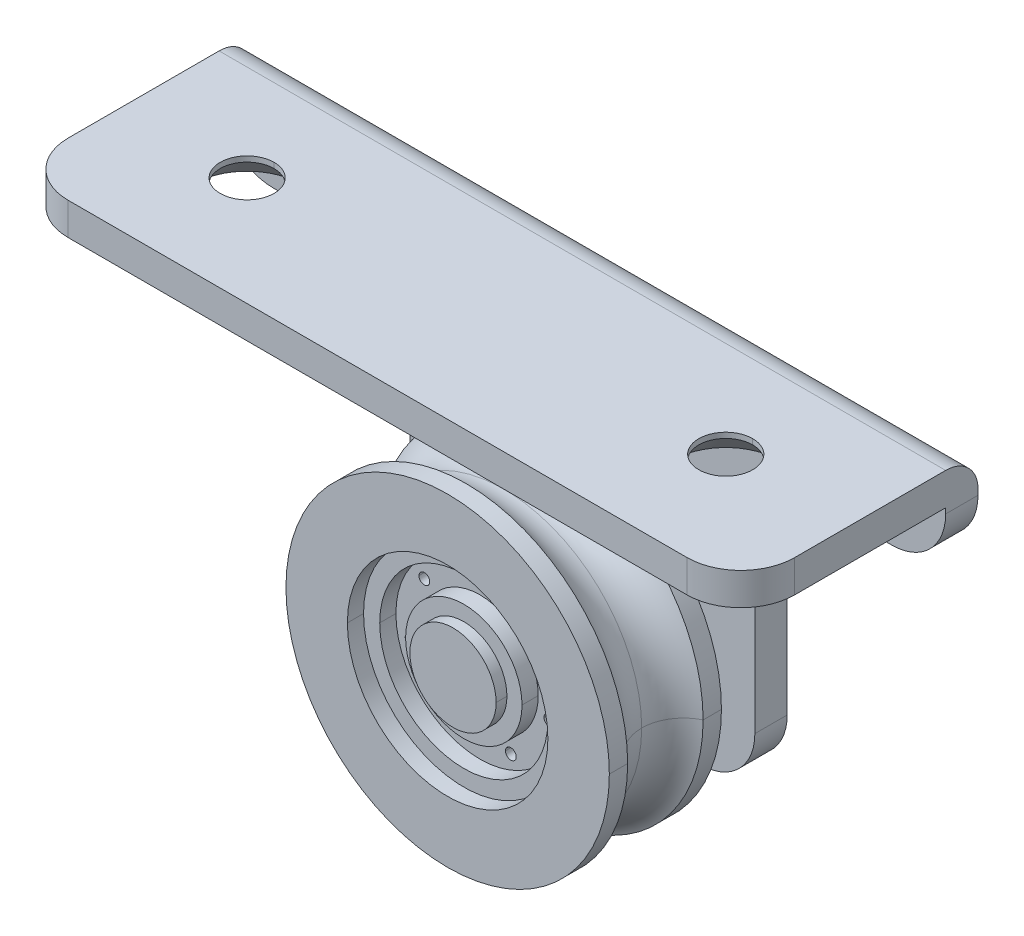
ISO-10303-21;
HEADER;
FILE_DESCRIPTION(('STEP AP214'),'2;1');
FILE_NAME('part.step','',(''),(''),'','','');
FILE_SCHEMA(('AUTOMOTIVE_DESIGN { 1 0 10303 214 1 1 1 1 }'));
ENDSEC;
DATA;
#1=APPLICATION_CONTEXT('core data for automotive mechanical design processes');
#2=APPLICATION_PROTOCOL_DEFINITION('international standard','automotive_design',2000,#1);
#3=PRODUCT_CONTEXT('',#1,'mechanical');
#4=PRODUCT('Part','Part','',(#3));
#5=PRODUCT_RELATED_PRODUCT_CATEGORY('part','',(#4));
#6=PRODUCT_DEFINITION_FORMATION('','',#4);
#7=PRODUCT_DEFINITION_CONTEXT('part definition',#1,'design');
#8=PRODUCT_DEFINITION('design','',#6,#7);
#9=PRODUCT_DEFINITION_SHAPE('','',#8);
#10=(LENGTH_UNIT() NAMED_UNIT(*) SI_UNIT(.MILLI.,.METRE.));
#11=(NAMED_UNIT(*) PLANE_ANGLE_UNIT() SI_UNIT($,.RADIAN.));
#12=(NAMED_UNIT(*) SI_UNIT($,.STERADIAN.) SOLID_ANGLE_UNIT());
#13=UNCERTAINTY_MEASURE_WITH_UNIT(LENGTH_MEASURE(1.E-05),#10,'distance_accuracy_value','');
#14=(GEOMETRIC_REPRESENTATION_CONTEXT(3) GLOBAL_UNCERTAINTY_ASSIGNED_CONTEXT((#13)) GLOBAL_UNIT_ASSIGNED_CONTEXT((#10,
#11,#12)) REPRESENTATION_CONTEXT('',''));
#15=CARTESIAN_POINT('',(0.,0.,0.));
#16=DIRECTION('',(0.,0.,1.));
#17=DIRECTION('',(1.,0.,0.));
#18=AXIS2_PLACEMENT_3D('',#15,#16,#17);
#19=CARTESIAN_POINT('',(0.,7.5,-0.5));
#20=DIRECTION('',(0.,0.,-1.));
#21=DIRECTION('',(0.,-1.,0.));
#22=AXIS2_PLACEMENT_3D('',#19,#20,#21);
#23=PLANE('',#22);
#24=CARTESIAN_POINT('',(0.,7.5,-0.5));
#25=DIRECTION('',(0.,0.,-1.));
#26=DIRECTION('',(-1.,0.,0.));
#27=AXIS2_PLACEMENT_3D('',#24,#25,#26);
#28=CIRCLE('',#27,0.266846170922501);
#29=CARTESIAN_POINT('',(-0.266846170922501,7.5,-0.5));
#30=VERTEX_POINT('',#29);
#31=CARTESIAN_POINT('',(0.266846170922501,7.5,-0.5));
#32=VERTEX_POINT('',#31);
#33=EDGE_CURVE('E10',#30,#32,#28,.T.);
#34=ORIENTED_EDGE('',*,*,#33,.T.);
#35=CARTESIAN_POINT('',(0.,7.5,-0.5));
#36=DIRECTION('',(0.,0.,-1.));
#37=DIRECTION('',(-1.,0.,0.));
#38=AXIS2_PLACEMENT_3D('',#35,#36,#37);
#39=CIRCLE('',#38,0.266846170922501);
#40=EDGE_CURVE('E1042',#32,#30,#39,.T.);
#41=ORIENTED_EDGE('',*,*,#40,.T.);
#42=EDGE_LOOP('',(#34,#41));
#43=FACE_BOUND('',#42,.T.);
#44=ADVANCED_FACE('F17',(#43),#23,.T.);
#45=CARTESIAN_POINT('',(0.,7.5,-1.));
#46=DIRECTION('',(0.,0.,-1.));
#47=DIRECTION('',(-1.,0.,0.));
#48=AXIS2_PLACEMENT_3D('',#45,#46,#47);
#49=CONICAL_SURFACE('',#48,0.5,0.436332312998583);
#50=DIRECTION('',(0.4226182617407,0.,-0.90630778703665));
#51=VECTOR('',#50,1.);
#52=CARTESIAN_POINT('',(0.5,7.5,-1.));
#53=LINE('',#52,#51);
#54=CARTESIAN_POINT('',(0.450068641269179,7.5,-0.892921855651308));
#55=VERTEX_POINT('',#54);
#56=EDGE_CURVE('E1053',#32,#55,#53,.T.);
#57=ORIENTED_EDGE('',*,*,#56,.F.);
#58=ORIENTED_EDGE('',*,*,#33,.F.);
#59=DIRECTION('',(-0.4226182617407,0.,-0.90630778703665));
#60=VECTOR('',#59,1.);
#61=CARTESIAN_POINT('',(-0.5,7.5,-1.));
#62=LINE('',#61,#60);
#63=CARTESIAN_POINT('',(-0.450068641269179,7.5,-0.892921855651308));
#64=VERTEX_POINT('',#63);
#65=EDGE_CURVE('E1011',#30,#64,#62,.T.);
#66=ORIENTED_EDGE('',*,*,#65,.T.);
#67=CARTESIAN_POINT('',(0.,7.5,-0.892921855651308));
#68=DIRECTION('',(0.,0.,-1.));
#69=DIRECTION('',(1.,0.,0.));
#70=AXIS2_PLACEMENT_3D('',#67,#68,#69);
#71=CIRCLE('',#70,0.450068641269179);
#72=EDGE_CURVE('E1005',#64,#55,#71,.T.);
#73=ORIENTED_EDGE('',*,*,#72,.T.);
#74=EDGE_LOOP('',(#57,#58,#66,#73));
#75=FACE_BOUND('',#74,.T.);
#76=ADVANCED_FACE('F1309',(#75),#49,.F.);
#77=CARTESIAN_POINT('',(0.,7.5,13.4125));
#78=DIRECTION('',(0.,1.,0.));
#79=DIRECTION('',(1.,0.,0.));
#80=AXIS2_PLACEMENT_3D('',#77,#78,#79);
#81=SPHERICAL_SURFACE('',#80,14.3125);
#82=CARTESIAN_POINT('',(0.,7.5,13.4125));
#83=DIRECTION('',(0.,1.,0.));
#84=DIRECTION('',(-1.,0.,0.));
#85=AXIS2_PLACEMENT_3D('',#82,#83,#84);
#86=CIRCLE('',#85,14.3125);
#87=CARTESIAN_POINT('',(-3.75,7.5,-0.4));
#88=VERTEX_POINT('',#87);
#89=EDGE_CURVE('E980',#64,#88,#86,.T.);
#90=ORIENTED_EDGE('',*,*,#89,.F.);
#91=CARTESIAN_POINT('',(0.,7.5,-0.892921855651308));
#92=DIRECTION('',(0.,0.,-1.));
#93=DIRECTION('',(1.,0.,0.));
#94=AXIS2_PLACEMENT_3D('',#91,#92,#93);
#95=CIRCLE('',#94,0.450068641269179);
#96=EDGE_CURVE('E1049',#55,#64,#95,.T.);
#97=ORIENTED_EDGE('',*,*,#96,.F.);
#98=CARTESIAN_POINT('',(0.,7.5,13.4125));
#99=DIRECTION('',(0.,-1.,0.));
#100=DIRECTION('',(0.,0.,-1.));
#101=AXIS2_PLACEMENT_3D('',#98,#99,#100);
#102=CIRCLE('',#101,14.3125);
#103=CARTESIAN_POINT('',(3.75,7.5,-0.4));
#104=VERTEX_POINT('',#103);
#105=EDGE_CURVE('E982',#55,#104,#102,.T.);
#106=ORIENTED_EDGE('',*,*,#105,.T.);
#107=CARTESIAN_POINT('',(0.,7.5,-0.4));
#108=DIRECTION('',(0.,0.,-1.));
#109=DIRECTION('',(-1.,0.,0.));
#110=AXIS2_PLACEMENT_3D('',#107,#108,#109);
#111=CIRCLE('',#110,3.75);
#112=EDGE_CURVE('E26',#104,#88,#111,.T.);
#113=ORIENTED_EDGE('',*,*,#112,.T.);
#114=EDGE_LOOP('',(#90,#97,#106,#113));
#115=FACE_BOUND('',#114,.T.);
#116=ADVANCED_FACE('F977',(#115),#81,.T.);
#117=CARTESIAN_POINT('',(0.,7.5,-0.4));
#118=DIRECTION('',(0.,0.,1.));
#119=DIRECTION('',(1.,0.,0.));
#120=AXIS2_PLACEMENT_3D('',#117,#118,#119);
#121=CYLINDRICAL_SURFACE('',#120,3.75);
#122=DIRECTION('',(0.,0.,1.));
#123=VECTOR('',#122,1.);
#124=CARTESIAN_POINT('',(-3.75,7.5,-0.4));
#125=LINE('',#124,#123);
#126=CARTESIAN_POINT('',(-3.75,7.5,0.));
#127=VERTEX_POINT('',#126);
#128=EDGE_CURVE('E988',#88,#127,#125,.T.);
#129=ORIENTED_EDGE('',*,*,#128,.F.);
#130=ORIENTED_EDGE('',*,*,#112,.F.);
#131=DIRECTION('',(0.,0.,1.));
#132=VECTOR('',#131,1.);
#133=CARTESIAN_POINT('',(3.75,7.5,-0.4));
#134=LINE('',#133,#132);
#135=CARTESIAN_POINT('',(3.75,7.5,0.));
#136=VERTEX_POINT('',#135);
#137=EDGE_CURVE('E999',#104,#136,#134,.T.);
#138=ORIENTED_EDGE('',*,*,#137,.T.);
#139=CARTESIAN_POINT('',(0.,7.5,0.));
#140=DIRECTION('',(0.,0.,-1.));
#141=DIRECTION('',(1.,0.,0.));
#142=AXIS2_PLACEMENT_3D('',#139,#140,#141);
#143=CIRCLE('',#142,3.75);
#144=EDGE_CURVE('E662',#136,#127,#143,.T.);
#145=ORIENTED_EDGE('',*,*,#144,.T.);
#146=EDGE_LOOP('',(#129,#130,#138,#145));
#147=FACE_BOUND('',#146,.T.);
#148=ADVANCED_FACE('F990',(#147),#121,.T.);
#149=CARTESIAN_POINT('',(0.,7.5,10.3));
#150=DIRECTION('',(0.,0.,-1.));
#151=DIRECTION('',(-1.,0.,0.));
#152=AXIS2_PLACEMENT_3D('',#149,#150,#151);
#153=TOROIDAL_SURFACE('',#152,16.6840909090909,3.88409090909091);
#154=CARTESIAN_POINT('',(0.,7.5,10.3));
#155=DIRECTION('',(0.,0.,-1.));
#156=DIRECTION('',(-1.,0.,0.));
#157=AXIS2_PLACEMENT_3D('',#154,#155,#156);
#158=CIRCLE('',#157,12.8);
#159=CARTESIAN_POINT('',(-12.8,7.5,10.3));
#160=VERTEX_POINT('',#159);
#161=CARTESIAN_POINT('',(12.8,7.5,10.3));
#162=VERTEX_POINT('',#161);
#163=EDGE_CURVE('E1017',#160,#162,#158,.T.);
#164=ORIENTED_EDGE('',*,*,#163,.F.);
#165=CARTESIAN_POINT('',(-16.6840909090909,7.5,10.3));
#166=DIRECTION('',(0.,-1.,0.));
#167=DIRECTION('',(0.,0.,-1.));
#168=AXIS2_PLACEMENT_3D('',#165,#166,#167);
#169=CIRCLE('',#168,3.88409090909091);
#170=CARTESIAN_POINT('',(-15.,7.5,13.8));
#171=VERTEX_POINT('',#170);
#172=EDGE_CURVE('E1099',#160,#171,#169,.T.);
#173=ORIENTED_EDGE('',*,*,#172,.T.);
#174=CARTESIAN_POINT('',(0.,7.5,13.8));
#175=DIRECTION('',(0.,0.,-1.));
#176=DIRECTION('',(-1.,0.,0.));
#177=AXIS2_PLACEMENT_3D('',#174,#175,#176);
#178=CIRCLE('',#177,15.);
#179=CARTESIAN_POINT('',(15.,7.5,13.8));
#180=VERTEX_POINT('',#179);
#181=EDGE_CURVE('E622',#171,#180,#178,.T.);
#182=ORIENTED_EDGE('',*,*,#181,.T.);
#183=CARTESIAN_POINT('',(16.6840909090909,7.5,10.3));
#184=DIRECTION('',(0.,1.,0.));
#185=DIRECTION('',(-1.,0.,0.));
#186=AXIS2_PLACEMENT_3D('',#183,#184,#185);
#187=CIRCLE('',#186,3.88409090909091);
#188=EDGE_CURVE('E1100',#162,#180,#187,.T.);
#189=ORIENTED_EDGE('',*,*,#188,.F.);
#190=EDGE_LOOP('',(#164,#173,#182,#189));
#191=FACE_BOUND('',#190,.T.);
#192=ADVANCED_FACE('F1469',(#191),#153,.F.);
#193=CARTESIAN_POINT('',(0.,7.5,5.1));
#194=DIRECTION('',(0.,0.,1.));
#195=DIRECTION('',(1.,0.,0.));
#196=AXIS2_PLACEMENT_3D('',#193,#194,#195);
#197=CYLINDRICAL_SURFACE('',#196,9.3);
#198=DIRECTION('',(0.,0.,1.));
#199=VECTOR('',#198,1.);
#200=CARTESIAN_POINT('',(-9.3,7.5,5.1));
#201=LINE('',#200,#199);
#202=CARTESIAN_POINT('',(-9.3,7.5,14.));
#203=VERTEX_POINT('',#202);
#204=CARTESIAN_POINT('',(-9.3,7.5,15.5));
#205=VERTEX_POINT('',#204);
#206=EDGE_CURVE('E1130',#203,#205,#201,.T.);
#207=ORIENTED_EDGE('',*,*,#206,.F.);
#208=CARTESIAN_POINT('',(0.,7.5,14.));
#209=DIRECTION('',(0.,0.,1.));
#210=DIRECTION('',(1.,0.,0.));
#211=AXIS2_PLACEMENT_3D('',#208,#209,#210);
#212=CIRCLE('',#211,9.3);
#213=CARTESIAN_POINT('',(9.3,7.5,14.));
#214=VERTEX_POINT('',#213);
#215=EDGE_CURVE('E958',#214,#203,#212,.T.);
#216=ORIENTED_EDGE('',*,*,#215,.F.);
#217=DIRECTION('',(0.,0.,1.));
#218=VECTOR('',#217,1.);
#219=CARTESIAN_POINT('',(9.3,7.5,5.1));
#220=LINE('',#219,#218);
#221=CARTESIAN_POINT('',(9.3,7.5,15.5));
#222=VERTEX_POINT('',#221);
#223=EDGE_CURVE('E1087',#214,#222,#220,.T.);
#224=ORIENTED_EDGE('',*,*,#223,.T.);
#225=CARTESIAN_POINT('',(0.,7.5,15.5));
#226=DIRECTION('',(0.,0.,1.));
#227=DIRECTION('',(1.,0.,0.));
#228=AXIS2_PLACEMENT_3D('',#225,#226,#227);
#229=CIRCLE('',#228,9.3);
#230=EDGE_CURVE('E970',#222,#205,#229,.T.);
#231=ORIENTED_EDGE('',*,*,#230,.T.);
#232=EDGE_LOOP('',(#207,#216,#224,#231));
#233=FACE_BOUND('',#232,.T.);
#234=ADVANCED_FACE('F1546',(#233),#197,.F.);
#235=CARTESIAN_POINT('',(0.,7.5,15.5));
#236=DIRECTION('',(0.,0.,1.));
#237=DIRECTION('',(1.,0.,0.));
#238=AXIS2_PLACEMENT_3D('',#235,#236,#237);
#239=PLANE('',#238);
#240=ORIENTED_EDGE('',*,*,#230,.F.);
#241=CARTESIAN_POINT('',(0.,7.5,15.5));
#242=DIRECTION('',(0.,0.,1.));
#243=DIRECTION('',(1.,0.,0.));
#244=AXIS2_PLACEMENT_3D('',#241,#242,#243);
#245=CIRCLE('',#244,9.3);
#246=EDGE_CURVE('E1092',#205,#222,#245,.T.);
#247=ORIENTED_EDGE('',*,*,#246,.F.);
#248=EDGE_LOOP('',(#240,#247));
#249=FACE_BOUND('',#248,.T.);
#250=CARTESIAN_POINT('',(0.,7.5,15.5));
#251=DIRECTION('',(0.,0.,1.));
#252=DIRECTION('',(1.,0.,0.));
#253=AXIS2_PLACEMENT_3D('',#250,#251,#252);
#254=CIRCLE('',#253,15.);
#255=CARTESIAN_POINT('',(15.,7.5,15.5));
#256=VERTEX_POINT('',#255);
#257=CARTESIAN_POINT('',(-15.,7.5,15.5));
#258=VERTEX_POINT('',#257);
#259=EDGE_CURVE('E717',#256,#258,#254,.T.);
#260=ORIENTED_EDGE('',*,*,#259,.T.);
#261=CARTESIAN_POINT('',(0.,7.5,15.5));
#262=DIRECTION('',(0.,0.,1.));
#263=DIRECTION('',(1.,0.,0.));
#264=AXIS2_PLACEMENT_3D('',#261,#262,#263);
#265=CIRCLE('',#264,15.);
#266=EDGE_CURVE('E758',#258,#256,#265,.T.);
#267=ORIENTED_EDGE('',*,*,#266,.T.);
#268=EDGE_LOOP('',(#260,#267));
#269=FACE_BOUND('',#268,.T.);
#270=ADVANCED_FACE('F1437',(#249,#269),#239,.T.);
#271=CARTESIAN_POINT('',(0.,7.5,5.1));
#272=DIRECTION('',(0.,0.,1.));
#273=DIRECTION('',(1.,0.,0.));
#274=AXIS2_PLACEMENT_3D('',#271,#272,#273);
#275=PLANE('',#274);
#276=CARTESIAN_POINT('',(0.,7.5,5.1));
#277=DIRECTION('',(0.,0.,1.));
#278=DIRECTION('',(1.,0.,0.));
#279=AXIS2_PLACEMENT_3D('',#276,#277,#278);
#280=CIRCLE('',#279,9.3);
#281=CARTESIAN_POINT('',(9.3,7.5,5.1));
#282=VERTEX_POINT('',#281);
#283=CARTESIAN_POINT('',(-9.3,7.5,5.1));
#284=VERTEX_POINT('',#283);
#285=EDGE_CURVE('E967',#282,#284,#280,.T.);
#286=ORIENTED_EDGE('',*,*,#285,.T.);
#287=CARTESIAN_POINT('',(0.,7.5,5.1));
#288=DIRECTION('',(0.,0.,1.));
#289=DIRECTION('',(1.,0.,0.));
#290=AXIS2_PLACEMENT_3D('',#287,#288,#289);
#291=CIRCLE('',#290,9.3);
#292=EDGE_CURVE('E1091',#284,#282,#291,.T.);
#293=ORIENTED_EDGE('',*,*,#292,.T.);
#294=EDGE_LOOP('',(#286,#293));
#295=FACE_BOUND('',#294,.T.);
#296=CARTESIAN_POINT('',(0.,7.5,5.1));
#297=DIRECTION('',(0.,0.,1.));
#298=DIRECTION('',(1.,0.,0.));
#299=AXIS2_PLACEMENT_3D('',#296,#297,#298);
#300=CIRCLE('',#299,15.);
#301=CARTESIAN_POINT('',(15.,7.5,5.1));
#302=VERTEX_POINT('',#301);
#303=CARTESIAN_POINT('',(-15.,7.5,5.1));
#304=VERTEX_POINT('',#303);
#305=EDGE_CURVE('E747',#302,#304,#300,.T.);
#306=ORIENTED_EDGE('',*,*,#305,.F.);
#307=CARTESIAN_POINT('',(0.,7.5,5.1));
#308=DIRECTION('',(0.,0.,1.));
#309=DIRECTION('',(1.,0.,0.));
#310=AXIS2_PLACEMENT_3D('',#307,#308,#309);
#311=CIRCLE('',#310,15.);
#312=EDGE_CURVE('E672',#304,#302,#311,.T.);
#313=ORIENTED_EDGE('',*,*,#312,.F.);
#314=EDGE_LOOP('',(#306,#313));
#315=FACE_BOUND('',#314,.T.);
#316=ADVANCED_FACE('F1433',(#295,#315),#275,.F.);
#317=CARTESIAN_POINT('',(0.,7.5,5.1));
#318=DIRECTION('',(0.,0.,1.));
#319=DIRECTION('',(1.,0.,0.));
#320=AXIS2_PLACEMENT_3D('',#317,#318,#319);
#321=CYLINDRICAL_SURFACE('',#320,9.3);
#322=DIRECTION('',(0.,0.,1.));
#323=VECTOR('',#322,1.);
#324=CARTESIAN_POINT('',(-9.3,7.5,5.1));
#325=LINE('',#324,#323);
#326=CARTESIAN_POINT('',(-9.3,7.5,6.6));
#327=VERTEX_POINT('',#326);
#328=EDGE_CURVE('E1146',#284,#327,#325,.T.);
#329=ORIENTED_EDGE('',*,*,#328,.F.);
#330=ORIENTED_EDGE('',*,*,#285,.F.);
#331=DIRECTION('',(0.,0.,1.));
#332=VECTOR('',#331,1.);
#333=CARTESIAN_POINT('',(9.3,7.5,5.1));
#334=LINE('',#333,#332);
#335=CARTESIAN_POINT('',(9.3,7.5,6.6));
#336=VERTEX_POINT('',#335);
#337=EDGE_CURVE('E1157',#282,#336,#334,.T.);
#338=ORIENTED_EDGE('',*,*,#337,.T.);
#339=CARTESIAN_POINT('',(0.,7.5,6.6));
#340=DIRECTION('',(0.,0.,1.));
#341=DIRECTION('',(1.,0.,0.));
#342=AXIS2_PLACEMENT_3D('',#339,#340,#341);
#343=CIRCLE('',#342,9.3);
#344=EDGE_CURVE('E964',#336,#327,#343,.T.);
#345=ORIENTED_EDGE('',*,*,#344,.T.);
#346=EDGE_LOOP('',(#329,#330,#338,#345));
#347=FACE_BOUND('',#346,.T.);
#348=ADVANCED_FACE('F1436',(#347),#321,.F.);
#349=CARTESIAN_POINT('',(0.,7.5,6.6));
#350=DIRECTION('',(0.,0.,1.));
#351=DIRECTION('',(1.,0.,0.));
#352=AXIS2_PLACEMENT_3D('',#349,#350,#351);
#353=PLANE('',#352);
#354=CARTESIAN_POINT('',(0.,7.5,6.6));
#355=DIRECTION('',(0.,0.,-1.));
#356=DIRECTION('',(1.,0.,0.));
#357=AXIS2_PLACEMENT_3D('',#354,#355,#356);
#358=CIRCLE('',#357,7.8);
#359=CARTESIAN_POINT('',(7.8,7.5,6.6));
#360=VERTEX_POINT('',#359);
#361=CARTESIAN_POINT('',(-7.8,7.5,6.6));
#362=VERTEX_POINT('',#361);
#363=EDGE_CURVE('E1066',#360,#362,#358,.T.);
#364=ORIENTED_EDGE('',*,*,#363,.F.);
#365=CARTESIAN_POINT('',(0.,7.5,6.6));
#366=DIRECTION('',(0.,0.,-1.));
#367=DIRECTION('',(1.,0.,0.));
#368=AXIS2_PLACEMENT_3D('',#365,#366,#367);
#369=CIRCLE('',#368,7.8);
#370=EDGE_CURVE('E955',#362,#360,#369,.T.);
#371=ORIENTED_EDGE('',*,*,#370,.F.);
#372=EDGE_LOOP('',(#364,#371));
#373=FACE_BOUND('',#372,.T.);
#374=ORIENTED_EDGE('',*,*,#344,.F.);
#375=CARTESIAN_POINT('',(0.,7.5,6.6));
#376=DIRECTION('',(0.,0.,1.));
#377=DIRECTION('',(1.,0.,0.));
#378=AXIS2_PLACEMENT_3D('',#375,#376,#377);
#379=CIRCLE('',#378,9.3);
#380=EDGE_CURVE('E1150',#327,#336,#379,.T.);
#381=ORIENTED_EDGE('',*,*,#380,.F.);
#382=EDGE_LOOP('',(#374,#381));
#383=FACE_BOUND('',#382,.T.);
#384=ADVANCED_FACE('F1600',(#373,#383),#353,.F.);
#385=CARTESIAN_POINT('',(0.,7.5,-21.2043722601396));
#386=DIRECTION('',(0.,0.,1.));
#387=DIRECTION('',(1.,0.,0.));
#388=AXIS2_PLACEMENT_3D('',#385,#386,#387);
#389=CYLINDRICAL_SURFACE('',#388,7.8);
#390=DIRECTION('',(0.,0.,1.));
#391=VECTOR('',#390,1.);
#392=CARTESIAN_POINT('',(-7.8,7.5,-21.2043722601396));
#393=LINE('',#392,#391);
#394=CARTESIAN_POINT('',(-7.8,7.5,12.5));
#395=VERTEX_POINT('',#394);
#396=CARTESIAN_POINT('',(-7.8,7.5,14.));
#397=VERTEX_POINT('',#396);
#398=EDGE_CURVE('E1175',#395,#397,#393,.T.);
#399=ORIENTED_EDGE('',*,*,#398,.F.);
#400=CARTESIAN_POINT('',(0.,7.5,12.5));
#401=DIRECTION('',(0.,0.,1.));
#402=DIRECTION('',(1.,0.,0.));
#403=AXIS2_PLACEMENT_3D('',#400,#401,#402);
#404=CIRCLE('',#403,7.8);
#405=CARTESIAN_POINT('',(7.8,7.5,12.5));
#406=VERTEX_POINT('',#405);
#407=EDGE_CURVE('E927',#406,#395,#404,.T.);
#408=ORIENTED_EDGE('',*,*,#407,.F.);
#409=DIRECTION('',(0.,0.,1.));
#410=VECTOR('',#409,1.);
#411=CARTESIAN_POINT('',(7.8,7.5,-21.2043722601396));
#412=LINE('',#411,#410);
#413=CARTESIAN_POINT('',(7.8,7.5,14.));
#414=VERTEX_POINT('',#413);
#415=EDGE_CURVE('E1071',#406,#414,#412,.T.);
#416=ORIENTED_EDGE('',*,*,#415,.T.);
#417=CARTESIAN_POINT('',(0.,7.5,14.));
#418=DIRECTION('',(0.,0.,1.));
#419=DIRECTION('',(1.,0.,0.));
#420=AXIS2_PLACEMENT_3D('',#417,#418,#419);
#421=CIRCLE('',#420,7.8);
#422=EDGE_CURVE('E961',#414,#397,#421,.T.);
#423=ORIENTED_EDGE('',*,*,#422,.T.);
#424=EDGE_LOOP('',(#399,#408,#416,#423));
#425=FACE_BOUND('',#424,.T.);
#426=ADVANCED_FACE('F1596',(#425),#389,.F.);
#427=CARTESIAN_POINT('',(0.,7.5,14.));
#428=DIRECTION('',(0.,0.,1.));
#429=DIRECTION('',(1.,0.,0.));
#430=AXIS2_PLACEMENT_3D('',#427,#428,#429);
#431=PLANE('',#430);
#432=ORIENTED_EDGE('',*,*,#422,.F.);
#433=CARTESIAN_POINT('',(0.,7.5,14.));
#434=DIRECTION('',(0.,0.,1.));
#435=DIRECTION('',(1.,0.,0.));
#436=AXIS2_PLACEMENT_3D('',#433,#434,#435);
#437=CIRCLE('',#436,7.8);
#438=EDGE_CURVE('E1179',#397,#414,#437,.T.);
#439=ORIENTED_EDGE('',*,*,#438,.F.);
#440=EDGE_LOOP('',(#432,#439));
#441=FACE_BOUND('',#440,.T.);
#442=ORIENTED_EDGE('',*,*,#215,.T.);
#443=CARTESIAN_POINT('',(0.,7.5,14.));
#444=DIRECTION('',(0.,0.,1.));
#445=DIRECTION('',(1.,0.,0.));
#446=AXIS2_PLACEMENT_3D('',#443,#444,#445);
#447=CIRCLE('',#446,9.3);
#448=EDGE_CURVE('E1123',#203,#214,#447,.T.);
#449=ORIENTED_EDGE('',*,*,#448,.T.);
#450=EDGE_LOOP('',(#442,#449));
#451=FACE_BOUND('',#450,.T.);
#452=ADVANCED_FACE('F1592',(#441,#451),#431,.T.);
#453=CARTESIAN_POINT('',(0.,7.5,-21.2043722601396));
#454=DIRECTION('',(0.,0.,1.));
#455=DIRECTION('',(1.,0.,0.));
#456=AXIS2_PLACEMENT_3D('',#453,#454,#455);
#457=CYLINDRICAL_SURFACE('',#456,7.8);
#458=DIRECTION('',(0.,0.,1.));
#459=VECTOR('',#458,1.);
#460=CARTESIAN_POINT('',(-7.8,7.5,-21.2043722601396));
#461=LINE('',#460,#459);
#462=CARTESIAN_POINT('',(-7.8,7.5,8.1));
#463=VERTEX_POINT('',#462);
#464=EDGE_CURVE('E1070',#362,#463,#461,.T.);
#465=ORIENTED_EDGE('',*,*,#464,.F.);
#466=ORIENTED_EDGE('',*,*,#370,.T.);
#467=DIRECTION('',(0.,0.,1.));
#468=VECTOR('',#467,1.);
#469=CARTESIAN_POINT('',(7.8,7.5,-21.2043722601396));
#470=LINE('',#469,#468);
#471=CARTESIAN_POINT('',(7.8,7.5,8.1));
#472=VERTEX_POINT('',#471);
#473=EDGE_CURVE('E1196',#360,#472,#470,.T.);
#474=ORIENTED_EDGE('',*,*,#473,.T.);
#475=CARTESIAN_POINT('',(0.,7.5,8.1));
#476=DIRECTION('',(0.,0.,1.));
#477=DIRECTION('',(1.,0.,0.));
#478=AXIS2_PLACEMENT_3D('',#475,#476,#477);
#479=CIRCLE('',#478,7.8);
#480=EDGE_CURVE('E908',#472,#463,#479,.T.);
#481=ORIENTED_EDGE('',*,*,#480,.T.);
#482=EDGE_LOOP('',(#465,#466,#474,#481));
#483=FACE_BOUND('',#482,.T.);
#484=ADVANCED_FACE('F1588',(#483),#457,.F.);
#485=CARTESIAN_POINT('',(0.,7.5,15.));
#486=DIRECTION('',(0.,0.,1.));
#487=DIRECTION('',(1.,0.,0.));
#488=AXIS2_PLACEMENT_3D('',#485,#486,#487);
#489=PLANE('',#488);
#490=CARTESIAN_POINT('',(0.,7.5,15.));
#491=DIRECTION('',(0.,0.,1.));
#492=DIRECTION('',(1.,0.,0.));
#493=AXIS2_PLACEMENT_3D('',#490,#491,#492);
#494=CIRCLE('',#493,4.);
#495=CARTESIAN_POINT('',(-4.,7.5,15.));
#496=VERTEX_POINT('',#495);
#497=CARTESIAN_POINT('',(4.,7.5,15.));
#498=VERTEX_POINT('',#497);
#499=EDGE_CURVE('E952',#496,#498,#494,.T.);
#500=ORIENTED_EDGE('',*,*,#499,.T.);
#501=CARTESIAN_POINT('',(0.,7.5,15.));
#502=DIRECTION('',(0.,0.,1.));
#503=DIRECTION('',(1.,0.,0.));
#504=AXIS2_PLACEMENT_3D('',#501,#502,#503);
#505=CIRCLE('',#504,4.);
#506=EDGE_CURVE('E1203',#498,#496,#505,.T.);
#507=ORIENTED_EDGE('',*,*,#506,.T.);
#508=EDGE_LOOP('',(#500,#507));
#509=FACE_BOUND('',#508,.T.);
#510=ADVANCED_FACE('F1584',(#509),#489,.T.);
#511=CARTESIAN_POINT('',(0.,7.5,15.));
#512=DIRECTION('',(0.,0.,-1.));
#513=DIRECTION('',(-1.,0.,0.));
#514=AXIS2_PLACEMENT_3D('',#511,#512,#513);
#515=CYLINDRICAL_SURFACE('',#514,4.);
#516=DIRECTION('',(0.,0.,-1.));
#517=VECTOR('',#516,1.);
#518=CARTESIAN_POINT('',(4.,7.5,15.));
#519=LINE('',#518,#517);
#520=CARTESIAN_POINT('',(4.,7.5,14.));
#521=VERTEX_POINT('',#520);
#522=EDGE_CURVE('E1015',#498,#521,#519,.T.);
#523=ORIENTED_EDGE('',*,*,#522,.F.);
#524=ORIENTED_EDGE('',*,*,#499,.F.);
#525=DIRECTION('',(0.,0.,-1.));
#526=VECTOR('',#525,1.);
#527=CARTESIAN_POINT('',(-4.,7.5,15.));
#528=LINE('',#527,#526);
#529=CARTESIAN_POINT('',(-4.,7.5,14.));
#530=VERTEX_POINT('',#529);
#531=EDGE_CURVE('E1062',#496,#530,#528,.T.);
#532=ORIENTED_EDGE('',*,*,#531,.T.);
#533=CARTESIAN_POINT('',(0.,7.5,14.));
#534=DIRECTION('',(0.,0.,1.));
#535=DIRECTION('',(1.,0.,0.));
#536=AXIS2_PLACEMENT_3D('',#533,#534,#535);
#537=CIRCLE('',#536,4.);
#538=EDGE_CURVE('E949',#530,#521,#537,.T.);
#539=ORIENTED_EDGE('',*,*,#538,.T.);
#540=EDGE_LOOP('',(#523,#524,#532,#539));
#541=FACE_BOUND('',#540,.T.);
#542=ADVANCED_FACE('F1417',(#541),#515,.T.);
#543=CARTESIAN_POINT('',(5.16008778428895,11.6150326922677,-0.001000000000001));
#544=DIRECTION('',(0.,0.,1.));
#545=DIRECTION('',(1.,0.,0.));
#546=AXIS2_PLACEMENT_3D('',#543,#544,#545);
#547=CYLINDRICAL_SURFACE('',#546,0.5);
#548=DIRECTION('',(0.,0.,1.));
#549=VECTOR('',#548,1.);
#550=CARTESIAN_POINT('',(4.66008778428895,11.6150326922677,-0.001000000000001));
#551=LINE('',#550,#549);
#552=CARTESIAN_POINT('',(4.66008778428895,11.6150326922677,8.1));
#553=VERTEX_POINT('',#552);
#554=CARTESIAN_POINT('',(4.66008778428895,11.6150326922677,12.5));
#555=VERTEX_POINT('',#554);
#556=EDGE_CURVE('E1061',#553,#555,#551,.T.);
#557=ORIENTED_EDGE('',*,*,#556,.F.);
#558=CARTESIAN_POINT('',(5.16008778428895,11.6150326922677,8.1));
#559=DIRECTION('',(0.,0.,-1.));
#560=DIRECTION('',(1.,0.,0.));
#561=AXIS2_PLACEMENT_3D('',#558,#559,#560);
#562=CIRCLE('',#561,0.5);
#563=CARTESIAN_POINT('',(5.66008778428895,11.6150326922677,8.1));
#564=VERTEX_POINT('',#563);
#565=EDGE_CURVE('E911',#553,#564,#562,.T.);
#566=ORIENTED_EDGE('',*,*,#565,.T.);
#567=DIRECTION('',(0.,0.,1.));
#568=VECTOR('',#567,1.);
#569=CARTESIAN_POINT('',(5.66008778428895,11.6150326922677,-0.001000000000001));
#570=LINE('',#569,#568);
#571=CARTESIAN_POINT('',(5.66008778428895,11.6150326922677,12.5));
#572=VERTEX_POINT('',#571);
#573=EDGE_CURVE('E1238',#564,#572,#570,.T.);
#574=ORIENTED_EDGE('',*,*,#573,.T.);
#575=CARTESIAN_POINT('',(5.16008778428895,11.6150326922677,12.5));
#576=DIRECTION('',(0.,0.,1.));
#577=DIRECTION('',(0.623489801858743,-0.781831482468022,0.));
#578=AXIS2_PLACEMENT_3D('',#575,#576,#577);
#579=CIRCLE('',#578,0.5);
#580=EDGE_CURVE('E590',#572,#555,#579,.T.);
#581=ORIENTED_EDGE('',*,*,#580,.T.);
#582=EDGE_LOOP('',(#557,#566,#574,#581));
#583=FACE_BOUND('',#582,.T.);
#584=ADVANCED_FACE('F1413',(#583),#547,.F.);
#585=CARTESIAN_POINT('',(6.43452422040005,6.03136183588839,-0.001000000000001));
#586=DIRECTION('',(0.,0.,1.));
#587=DIRECTION('',(1.,0.,0.));
#588=AXIS2_PLACEMENT_3D('',#585,#586,#587);
#589=CYLINDRICAL_SURFACE('',#588,0.5);
#590=DIRECTION('',(0.,0.,1.));
#591=VECTOR('',#590,1.);
#592=CARTESIAN_POINT('',(5.93452422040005,6.03136183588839,-0.001000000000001));
#593=LINE('',#592,#591);
#594=CARTESIAN_POINT('',(5.93452422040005,6.03136183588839,8.1));
#595=VERTEX_POINT('',#594);
#596=CARTESIAN_POINT('',(5.93452422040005,6.03136183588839,12.5));
#597=VERTEX_POINT('',#596);
#598=EDGE_CURVE('E1245',#595,#597,#593,.T.);
#599=ORIENTED_EDGE('',*,*,#598,.F.);
#600=CARTESIAN_POINT('',(6.43452422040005,6.03136183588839,8.1));
#601=DIRECTION('',(0.,0.,-1.));
#602=DIRECTION('',(1.,0.,0.));
#603=AXIS2_PLACEMENT_3D('',#600,#601,#602);
#604=CIRCLE('',#603,0.5);
#605=CARTESIAN_POINT('',(6.93452422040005,6.03136183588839,8.1));
#606=VERTEX_POINT('',#605);
#607=EDGE_CURVE('E914',#595,#606,#604,.T.);
#608=ORIENTED_EDGE('',*,*,#607,.T.);
#609=DIRECTION('',(0.,0.,1.));
#610=VECTOR('',#609,1.);
#611=CARTESIAN_POINT('',(6.93452422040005,6.03136183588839,-0.001000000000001));
#612=LINE('',#611,#610);
#613=CARTESIAN_POINT('',(6.93452422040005,6.03136183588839,12.5));
#614=VERTEX_POINT('',#613);
#615=EDGE_CURVE('E570',#606,#614,#612,.T.);
#616=ORIENTED_EDGE('',*,*,#615,.T.);
#617=CARTESIAN_POINT('',(6.43452422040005,6.03136183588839,12.5));
#618=DIRECTION('',(0.,0.,1.));
#619=DIRECTION('',(-0.222520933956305,-0.974927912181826,0.));
#620=AXIS2_PLACEMENT_3D('',#617,#618,#619);
#621=CIRCLE('',#620,0.5);
#622=EDGE_CURVE('E548',#614,#597,#621,.T.);
#623=ORIENTED_EDGE('',*,*,#622,.T.);
#624=EDGE_LOOP('',(#599,#608,#616,#623));
#625=FACE_BOUND('',#624,.T.);
#626=ADVANCED_FACE('F1416',(#625),#589,.F.);
#627=CARTESIAN_POINT('',(2.86363267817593,1.55360547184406,-0.001000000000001));
#628=DIRECTION('',(0.,0.,1.));
#629=DIRECTION('',(1.,0.,0.));
#630=AXIS2_PLACEMENT_3D('',#627,#628,#629);
#631=CYLINDRICAL_SURFACE('',#630,0.5);
#632=DIRECTION('',(0.,0.,1.));
#633=VECTOR('',#632,1.);
#634=CARTESIAN_POINT('',(2.36363267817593,1.55360547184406,-0.001000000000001));
#635=LINE('',#634,#633);
#636=CARTESIAN_POINT('',(2.36363267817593,1.55360547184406,8.1));
#637=VERTEX_POINT('',#636);
#638=CARTESIAN_POINT('',(2.36363267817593,1.55360547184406,12.5));
#639=VERTEX_POINT('',#638);
#640=EDGE_CURVE('E561',#637,#639,#635,.T.);
#641=ORIENTED_EDGE('',*,*,#640,.F.);
#642=CARTESIAN_POINT('',(2.86363267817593,1.55360547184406,8.1));
#643=DIRECTION('',(0.,0.,-1.));
#644=DIRECTION('',(1.,0.,0.));
#645=AXIS2_PLACEMENT_3D('',#642,#643,#644);
#646=CIRCLE('',#645,0.5);
#647=CARTESIAN_POINT('',(3.36363267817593,1.55360547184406,8.1));
#648=VERTEX_POINT('',#647);
#649=EDGE_CURVE('E553',#637,#648,#646,.T.);
#650=ORIENTED_EDGE('',*,*,#649,.T.);
#651=DIRECTION('',(0.,0.,1.));
#652=VECTOR('',#651,1.);
#653=CARTESIAN_POINT('',(3.36363267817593,1.55360547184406,-0.001000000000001));
#654=LINE('',#653,#652);
#655=CARTESIAN_POINT('',(3.36363267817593,1.55360547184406,12.5));
#656=VERTEX_POINT('',#655);
#657=EDGE_CURVE('E551',#648,#656,#654,.T.);
#658=ORIENTED_EDGE('',*,*,#657,.T.);
#659=CARTESIAN_POINT('',(2.86363267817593,1.55360547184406,12.5));
#660=DIRECTION('',(0.,0.,1.));
#661=DIRECTION('',(-0.900968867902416,-0.433883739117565,0.));
#662=AXIS2_PLACEMENT_3D('',#659,#660,#661);
#663=CIRCLE('',#662,0.5);
#664=EDGE_CURVE('E537',#656,#639,#663,.T.);
#665=ORIENTED_EDGE('',*,*,#664,.T.);
#666=EDGE_LOOP('',(#641,#650,#658,#665));
#667=FACE_BOUND('',#666,.T.);
#668=ADVANCED_FACE('F552',(#667),#631,.F.);
#669=CARTESIAN_POINT('',(-2.86363267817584,1.55360547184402,-0.001000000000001));
#670=DIRECTION('',(0.,0.,1.));
#671=DIRECTION('',(1.,0.,0.));
#672=AXIS2_PLACEMENT_3D('',#669,#670,#671);
#673=CYLINDRICAL_SURFACE('',#672,0.5);
#674=DIRECTION('',(0.,0.,1.));
#675=VECTOR('',#674,1.);
#676=CARTESIAN_POINT('',(-3.36363267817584,1.55360547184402,-0.001000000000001));
#677=LINE('',#676,#675);
#678=CARTESIAN_POINT('',(-3.36363267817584,1.55360547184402,8.1));
#679=VERTEX_POINT('',#678);
#680=CARTESIAN_POINT('',(-3.36363267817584,1.55360547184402,12.5));
#681=VERTEX_POINT('',#680);
#682=EDGE_CURVE('E582',#679,#681,#677,.T.);
#683=ORIENTED_EDGE('',*,*,#682,.F.);
#684=CARTESIAN_POINT('',(-2.86363267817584,1.55360547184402,8.1));
#685=DIRECTION('',(0.,0.,-1.));
#686=DIRECTION('',(1.,0.,0.));
#687=AXIS2_PLACEMENT_3D('',#684,#685,#686);
#688=CIRCLE('',#687,0.5);
#689=CARTESIAN_POINT('',(-2.36363267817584,1.55360547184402,8.1));
#690=VERTEX_POINT('',#689);
#691=EDGE_CURVE('E733',#679,#690,#688,.T.);
#692=ORIENTED_EDGE('',*,*,#691,.T.);
#693=DIRECTION('',(0.,0.,1.));
#694=VECTOR('',#693,1.);
#695=CARTESIAN_POINT('',(-2.36363267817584,1.55360547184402,-0.001000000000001));
#696=LINE('',#695,#694);
#697=CARTESIAN_POINT('',(-2.36363267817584,1.55360547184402,12.5));
#698=VERTEX_POINT('',#697);
#699=EDGE_CURVE('E595',#690,#698,#696,.T.);
#700=ORIENTED_EDGE('',*,*,#699,.T.);
#701=CARTESIAN_POINT('',(-2.86363267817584,1.55360547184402,12.5));
#702=DIRECTION('',(0.,0.,1.));
#703=DIRECTION('',(-0.900968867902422,0.433883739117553,0.));
#704=AXIS2_PLACEMENT_3D('',#701,#702,#703);
#705=CIRCLE('',#704,0.5);
#706=EDGE_CURVE('E547',#698,#681,#705,.T.);
#707=ORIENTED_EDGE('',*,*,#706,.T.);
#708=EDGE_LOOP('',(#683,#692,#700,#707));
#709=FACE_BOUND('',#708,.T.);
#710=ADVANCED_FACE('F1423',(#709),#673,.F.);
#711=CARTESIAN_POINT('',(-6.43452422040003,6.0313618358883,-0.001000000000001));
#712=DIRECTION('',(0.,0.,1.));
#713=DIRECTION('',(1.,0.,0.));
#714=AXIS2_PLACEMENT_3D('',#711,#712,#713);
#715=CYLINDRICAL_SURFACE('',#714,0.5);
#716=DIRECTION('',(0.,0.,1.));
#717=VECTOR('',#716,1.);
#718=CARTESIAN_POINT('',(-6.93452422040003,6.0313618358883,-0.001000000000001));
#719=LINE('',#718,#717);
#720=CARTESIAN_POINT('',(-6.93452422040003,6.0313618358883,8.1));
#721=VERTEX_POINT('',#720);
#722=CARTESIAN_POINT('',(-6.93452422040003,6.0313618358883,12.5));
#723=VERTEX_POINT('',#722);
#724=EDGE_CURVE('E1029',#721,#723,#719,.T.);
#725=ORIENTED_EDGE('',*,*,#724,.F.);
#726=CARTESIAN_POINT('',(-6.43452422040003,6.0313618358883,8.1));
#727=DIRECTION('',(0.,0.,-1.));
#728=DIRECTION('',(1.,0.,0.));
#729=AXIS2_PLACEMENT_3D('',#726,#727,#728);
#730=CIRCLE('',#729,0.5);
#731=CARTESIAN_POINT('',(-5.93452422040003,6.0313618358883,8.1));
#732=VERTEX_POINT('',#731);
#733=EDGE_CURVE('E736',#721,#732,#730,.T.);
#734=ORIENTED_EDGE('',*,*,#733,.T.);
#735=DIRECTION('',(0.,0.,1.));
#736=VECTOR('',#735,1.);
#737=CARTESIAN_POINT('',(-5.93452422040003,6.0313618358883,-0.001000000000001));
#738=LINE('',#737,#736);
#739=CARTESIAN_POINT('',(-5.93452422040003,6.0313618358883,12.5));
#740=VERTEX_POINT('',#739);
#741=EDGE_CURVE('E608',#732,#740,#738,.T.);
#742=ORIENTED_EDGE('',*,*,#741,.T.);
#743=CARTESIAN_POINT('',(-6.43452422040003,6.0313618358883,12.5));
#744=DIRECTION('',(0.,0.,1.));
#745=DIRECTION('',(-0.222520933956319,0.974927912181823,0.));
#746=AXIS2_PLACEMENT_3D('',#743,#744,#745);
#747=CIRCLE('',#746,0.5);
#748=EDGE_CURVE('E934',#740,#723,#747,.T.);
#749=ORIENTED_EDGE('',*,*,#748,.T.);
#750=EDGE_LOOP('',(#725,#734,#742,#749));
#751=FACE_BOUND('',#750,.T.);
#752=ADVANCED_FACE('F1419',(#751),#715,.F.);
#753=CARTESIAN_POINT('',(-5.160087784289,11.6150326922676,-0.001000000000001));
#754=DIRECTION('',(0.,0.,1.));
#755=DIRECTION('',(1.,0.,0.));
#756=AXIS2_PLACEMENT_3D('',#753,#754,#755);
#757=CYLINDRICAL_SURFACE('',#756,0.5);
#758=DIRECTION('',(0.,0.,1.));
#759=VECTOR('',#758,1.);
#760=CARTESIAN_POINT('',(-5.66008778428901,11.6150326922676,-0.001000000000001));
#761=LINE('',#760,#759);
#762=CARTESIAN_POINT('',(-5.66008778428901,11.6150326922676,8.1));
#763=VERTEX_POINT('',#762);
#764=CARTESIAN_POINT('',(-5.66008778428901,11.6150326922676,12.5));
#765=VERTEX_POINT('',#764);
#766=EDGE_CURVE('E617',#763,#765,#761,.T.);
#767=ORIENTED_EDGE('',*,*,#766,.F.);
#768=CARTESIAN_POINT('',(-5.160087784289,11.6150326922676,8.1));
#769=DIRECTION('',(0.,0.,-1.));
#770=DIRECTION('',(1.,0.,0.));
#771=AXIS2_PLACEMENT_3D('',#768,#769,#770);
#772=CIRCLE('',#771,0.5);
#773=CARTESIAN_POINT('',(-4.660087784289,11.6150326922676,8.1));
#774=VERTEX_POINT('',#773);
#775=EDGE_CURVE('E921',#763,#774,#772,.T.);
#776=ORIENTED_EDGE('',*,*,#775,.T.);
#777=DIRECTION('',(0.,0.,1.));
#778=VECTOR('',#777,1.);
#779=CARTESIAN_POINT('',(-4.660087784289,11.6150326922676,-0.001000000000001));
#780=LINE('',#779,#778);
#781=CARTESIAN_POINT('',(-4.660087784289,11.6150326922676,12.5));
#782=VERTEX_POINT('',#781);
#783=EDGE_CURVE('E628',#774,#782,#780,.T.);
#784=ORIENTED_EDGE('',*,*,#783,.T.);
#785=CARTESIAN_POINT('',(-5.160087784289,11.6150326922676,12.5));
#786=DIRECTION('',(0.,0.,1.));
#787=DIRECTION('',(0.623489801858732,0.781831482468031,0.));
#788=AXIS2_PLACEMENT_3D('',#785,#786,#787);
#789=CIRCLE('',#788,0.5);
#790=EDGE_CURVE('E937',#782,#765,#789,.T.);
#791=ORIENTED_EDGE('',*,*,#790,.T.);
#792=EDGE_LOOP('',(#767,#776,#784,#791));
#793=FACE_BOUND('',#792,.T.);
#794=ADVANCED_FACE('F1422',(#793),#757,.F.);
#795=CARTESIAN_POINT('',(0.,14.1,-0.001000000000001));
#796=DIRECTION('',(0.,0.,1.));
#797=DIRECTION('',(1.,0.,0.));
#798=AXIS2_PLACEMENT_3D('',#795,#796,#797);
#799=CYLINDRICAL_SURFACE('',#798,0.5);
#800=DIRECTION('',(0.,0.,1.));
#801=VECTOR('',#800,1.);
#802=CARTESIAN_POINT('',(-0.5,14.1,-0.001000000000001));
#803=LINE('',#802,#801);
#804=CARTESIAN_POINT('',(-0.5,14.1,8.1));
#805=VERTEX_POINT('',#804);
#806=CARTESIAN_POINT('',(-0.5,14.1,12.5));
#807=VERTEX_POINT('',#806);
#808=EDGE_CURVE('E633',#805,#807,#803,.T.);
#809=ORIENTED_EDGE('',*,*,#808,.F.);
#810=CARTESIAN_POINT('',(0.,14.1,8.1));
#811=DIRECTION('',(0.,0.,-1.));
#812=DIRECTION('',(1.,0.,0.));
#813=AXIS2_PLACEMENT_3D('',#810,#811,#812);
#814=CIRCLE('',#813,0.5);
#815=CARTESIAN_POINT('',(0.5,14.1,8.1));
#816=VERTEX_POINT('',#815);
#817=EDGE_CURVE('E924',#805,#816,#814,.T.);
#818=ORIENTED_EDGE('',*,*,#817,.T.);
#819=DIRECTION('',(0.,0.,1.));
#820=VECTOR('',#819,1.);
#821=CARTESIAN_POINT('',(0.5,14.1,-0.001000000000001));
#822=LINE('',#821,#820);
#823=CARTESIAN_POINT('',(0.5,14.1,12.5));
#824=VERTEX_POINT('',#823);
#825=EDGE_CURVE('E578',#816,#824,#822,.T.);
#826=ORIENTED_EDGE('',*,*,#825,.T.);
#827=CARTESIAN_POINT('',(0.,14.1,12.5));
#828=DIRECTION('',(0.,0.,1.));
#829=DIRECTION('',(1.,0.,0.));
#830=AXIS2_PLACEMENT_3D('',#827,#828,#829);
#831=CIRCLE('',#830,0.5);
#832=EDGE_CURVE('E940',#824,#807,#831,.T.);
#833=ORIENTED_EDGE('',*,*,#832,.T.);
#834=EDGE_LOOP('',(#809,#818,#826,#833));
#835=FACE_BOUND('',#834,.T.);
#836=ADVANCED_FACE('F1571',(#835),#799,.F.);
#837=CARTESIAN_POINT('',(0.,7.5,14.));
#838=DIRECTION('',(0.,0.,-1.));
#839=DIRECTION('',(-1.,0.,0.));
#840=AXIS2_PLACEMENT_3D('',#837,#838,#839);
#841=CYLINDRICAL_SURFACE('',#840,5.4);
#842=DIRECTION('',(0.,0.,-1.));
#843=VECTOR('',#842,1.);
#844=CARTESIAN_POINT('',(5.4,7.5,14.));
#845=LINE('',#844,#843);
#846=CARTESIAN_POINT('',(5.4,7.5,14.));
#847=VERTEX_POINT('',#846);
#848=CARTESIAN_POINT('',(5.4,7.5,12.5));
#849=VERTEX_POINT('',#848);
#850=EDGE_CURVE('E577',#847,#849,#845,.T.);
#851=ORIENTED_EDGE('',*,*,#850,.F.);
#852=CARTESIAN_POINT('',(0.,7.5,14.));
#853=DIRECTION('',(0.,0.,1.));
#854=DIRECTION('',(1.,0.,0.));
#855=AXIS2_PLACEMENT_3D('',#852,#853,#854);
#856=CIRCLE('',#855,5.4);
#857=CARTESIAN_POINT('',(-5.4,7.5,14.));
#858=VERTEX_POINT('',#857);
#859=EDGE_CURVE('E946',#858,#847,#856,.T.);
#860=ORIENTED_EDGE('',*,*,#859,.F.);
#861=DIRECTION('',(0.,0.,-1.));
#862=VECTOR('',#861,1.);
#863=CARTESIAN_POINT('',(-5.4,7.5,14.));
#864=LINE('',#863,#862);
#865=CARTESIAN_POINT('',(-5.4,7.5,12.5));
#866=VERTEX_POINT('',#865);
#867=EDGE_CURVE('E607',#858,#866,#864,.T.);
#868=ORIENTED_EDGE('',*,*,#867,.T.);
#869=CARTESIAN_POINT('',(0.,7.5,12.5));
#870=DIRECTION('',(0.,0.,1.));
#871=DIRECTION('',(1.,0.,0.));
#872=AXIS2_PLACEMENT_3D('',#869,#870,#871);
#873=CIRCLE('',#872,5.4);
#874=EDGE_CURVE('E943',#866,#849,#873,.T.);
#875=ORIENTED_EDGE('',*,*,#874,.T.);
#876=EDGE_LOOP('',(#851,#860,#868,#875));
#877=FACE_BOUND('',#876,.T.);
#878=ADVANCED_FACE('F1567',(#877),#841,.T.);
#879=CARTESIAN_POINT('',(0.,7.5,14.));
#880=DIRECTION('',(0.,0.,1.));
#881=DIRECTION('',(1.,0.,0.));
#882=AXIS2_PLACEMENT_3D('',#879,#880,#881);
#883=PLANE('',#882);
#884=ORIENTED_EDGE('',*,*,#538,.F.);
#885=CARTESIAN_POINT('',(0.,7.5,14.));
#886=DIRECTION('',(0.,0.,1.));
#887=DIRECTION('',(1.,0.,0.));
#888=AXIS2_PLACEMENT_3D('',#885,#886,#887);
#889=CIRCLE('',#888,4.);
#890=EDGE_CURVE('E1213',#521,#530,#889,.T.);
#891=ORIENTED_EDGE('',*,*,#890,.F.);
#892=EDGE_LOOP('',(#884,#891));
#893=FACE_BOUND('',#892,.T.);
#894=ORIENTED_EDGE('',*,*,#859,.T.);
#895=CARTESIAN_POINT('',(0.,7.5,14.));
#896=DIRECTION('',(0.,0.,1.));
#897=DIRECTION('',(1.,0.,0.));
#898=AXIS2_PLACEMENT_3D('',#895,#896,#897);
#899=CIRCLE('',#898,5.4);
#900=EDGE_CURVE('E573',#847,#858,#899,.T.);
#901=ORIENTED_EDGE('',*,*,#900,.T.);
#902=EDGE_LOOP('',(#894,#901));
#903=FACE_BOUND('',#902,.T.);
#904=ADVANCED_FACE('F1563',(#893,#903),#883,.T.);
#905=CARTESIAN_POINT('',(0.,7.5,12.5));
#906=DIRECTION('',(0.,0.,1.));
#907=DIRECTION('',(1.,0.,0.));
#908=AXIS2_PLACEMENT_3D('',#905,#906,#907);
#909=PLANE('',#908);
#910=ORIENTED_EDGE('',*,*,#874,.F.);
#911=CARTESIAN_POINT('',(0.,7.5,12.5));
#912=DIRECTION('',(0.,0.,1.));
#913=DIRECTION('',(1.,0.,0.));
#914=AXIS2_PLACEMENT_3D('',#911,#912,#913);
#915=CIRCLE('',#914,5.4);
#916=EDGE_CURVE('E603',#849,#866,#915,.T.);
#917=ORIENTED_EDGE('',*,*,#916,.F.);
#918=EDGE_LOOP('',(#910,#917));
#919=FACE_BOUND('',#918,.T.);
#920=ORIENTED_EDGE('',*,*,#832,.F.);
#921=CARTESIAN_POINT('',(0.,14.1,12.5));
#922=DIRECTION('',(0.,0.,1.));
#923=DIRECTION('',(1.,0.,0.));
#924=AXIS2_PLACEMENT_3D('',#921,#922,#923);
#925=CIRCLE('',#924,0.5);
#926=EDGE_CURVE('E629',#807,#824,#925,.T.);
#927=ORIENTED_EDGE('',*,*,#926,.F.);
#928=EDGE_LOOP('',(#920,#927));
#929=FACE_BOUND('',#928,.T.);
#930=ORIENTED_EDGE('',*,*,#790,.F.);
#931=CARTESIAN_POINT('',(-5.160087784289,11.6150326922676,12.5));
#932=DIRECTION('',(0.,0.,1.));
#933=DIRECTION('',(0.623489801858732,0.781831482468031,0.));
#934=AXIS2_PLACEMENT_3D('',#931,#932,#933);
#935=CIRCLE('',#934,0.5);
#936=EDGE_CURVE('E624',#765,#782,#935,.T.);
#937=ORIENTED_EDGE('',*,*,#936,.F.);
#938=EDGE_LOOP('',(#930,#937));
#939=FACE_BOUND('',#938,.T.);
#940=ORIENTED_EDGE('',*,*,#748,.F.);
#941=CARTESIAN_POINT('',(-6.43452422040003,6.0313618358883,12.5));
#942=DIRECTION('',(0.,0.,1.));
#943=DIRECTION('',(-0.222520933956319,0.974927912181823,0.));
#944=AXIS2_PLACEMENT_3D('',#941,#942,#943);
#945=CIRCLE('',#944,0.5);
#946=EDGE_CURVE('E613',#723,#740,#945,.T.);
#947=ORIENTED_EDGE('',*,*,#946,.F.);
#948=EDGE_LOOP('',(#940,#947));
#949=FACE_BOUND('',#948,.T.);
#950=ORIENTED_EDGE('',*,*,#706,.F.);
#951=CARTESIAN_POINT('',(-2.86363267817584,1.55360547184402,12.5));
#952=DIRECTION('',(0.,0.,1.));
#953=DIRECTION('',(-0.900968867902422,0.433883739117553,0.));
#954=AXIS2_PLACEMENT_3D('',#951,#952,#953);
#955=CIRCLE('',#954,0.5);
#956=EDGE_CURVE('E591',#681,#698,#955,.T.);
#957=ORIENTED_EDGE('',*,*,#956,.F.);
#958=EDGE_LOOP('',(#950,#957));
#959=FACE_BOUND('',#958,.T.);
#960=ORIENTED_EDGE('',*,*,#664,.F.);
#961=CARTESIAN_POINT('',(2.86363267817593,1.55360547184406,12.5));
#962=DIRECTION('',(0.,0.,1.));
#963=DIRECTION('',(-0.900968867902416,-0.433883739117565,0.));
#964=AXIS2_PLACEMENT_3D('',#961,#962,#963);
#965=CIRCLE('',#964,0.5);
#966=EDGE_CURVE('E542',#639,#656,#965,.T.);
#967=ORIENTED_EDGE('',*,*,#966,.F.);
#968=EDGE_LOOP('',(#960,#967));
#969=FACE_BOUND('',#968,.T.);
#970=ORIENTED_EDGE('',*,*,#622,.F.);
#971=CARTESIAN_POINT('',(6.43452422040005,6.03136183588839,12.5));
#972=DIRECTION('',(0.,0.,1.));
#973=DIRECTION('',(-0.222520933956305,-0.974927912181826,0.));
#974=AXIS2_PLACEMENT_3D('',#971,#972,#973);
#975=CIRCLE('',#974,0.5);
#976=EDGE_CURVE('E1250',#597,#614,#975,.T.);
#977=ORIENTED_EDGE('',*,*,#976,.F.);
#978=EDGE_LOOP('',(#970,#977));
#979=FACE_BOUND('',#978,.T.);
#980=ORIENTED_EDGE('',*,*,#580,.F.);
#981=CARTESIAN_POINT('',(5.16008778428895,11.6150326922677,12.5));
#982=DIRECTION('',(0.,0.,1.));
#983=DIRECTION('',(0.623489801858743,-0.781831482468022,0.));
#984=AXIS2_PLACEMENT_3D('',#981,#982,#983);
#985=CIRCLE('',#984,0.5);
#986=EDGE_CURVE('E1231',#555,#572,#985,.T.);
#987=ORIENTED_EDGE('',*,*,#986,.F.);
#988=EDGE_LOOP('',(#980,#987));
#989=FACE_BOUND('',#988,.T.);
#990=ORIENTED_EDGE('',*,*,#407,.T.);
#991=CARTESIAN_POINT('',(0.,7.5,12.5));
#992=DIRECTION('',(0.,0.,1.));
#993=DIRECTION('',(1.,0.,0.));
#994=AXIS2_PLACEMENT_3D('',#991,#992,#993);
#995=CIRCLE('',#994,7.8);
#996=EDGE_CURVE('E1169',#395,#406,#995,.T.);
#997=ORIENTED_EDGE('',*,*,#996,.T.);
#998=EDGE_LOOP('',(#990,#997));
#999=FACE_BOUND('',#998,.T.);
#1000=ADVANCED_FACE('F539',(#919,#929,#939,#949,#959,#969,#979,#989,#999),#909,.T.);
#1001=CARTESIAN_POINT('',(0.,7.5,8.1));
#1002=DIRECTION('',(0.,0.,1.));
#1003=DIRECTION('',(1.,0.,0.));
#1004=AXIS2_PLACEMENT_3D('',#1001,#1002,#1003);
#1005=PLANE('',#1004);
#1006=CARTESIAN_POINT('',(0.,7.5,8.1));
#1007=DIRECTION('',(0.,0.,1.));
#1008=DIRECTION('',(1.,0.,0.));
#1009=AXIS2_PLACEMENT_3D('',#1006,#1007,#1008);
#1010=CIRCLE('',#1009,5.4);
#1011=CARTESIAN_POINT('',(-5.4,7.5,8.1));
#1012=VERTEX_POINT('',#1011);
#1013=CARTESIAN_POINT('',(5.4,7.5,8.1));
#1014=VERTEX_POINT('',#1013);
#1015=EDGE_CURVE('E763',#1012,#1014,#1010,.T.);
#1016=ORIENTED_EDGE('',*,*,#1015,.T.);
#1017=CARTESIAN_POINT('',(0.,7.5,8.1));
#1018=DIRECTION('',(0.,0.,1.));
#1019=DIRECTION('',(1.,0.,0.));
#1020=AXIS2_PLACEMENT_3D('',#1017,#1018,#1019);
#1021=CIRCLE('',#1020,5.4);
#1022=EDGE_CURVE('E1109',#1014,#1012,#1021,.T.);
#1023=ORIENTED_EDGE('',*,*,#1022,.T.);
#1024=EDGE_LOOP('',(#1016,#1023));
#1025=FACE_BOUND('',#1024,.T.);
#1026=CARTESIAN_POINT('',(0.,14.1,8.1));
#1027=DIRECTION('',(0.,0.,-1.));
#1028=DIRECTION('',(1.,0.,0.));
#1029=AXIS2_PLACEMENT_3D('',#1026,#1027,#1028);
#1030=CIRCLE('',#1029,0.5);
#1031=EDGE_CURVE('E1085',#816,#805,#1030,.T.);
#1032=ORIENTED_EDGE('',*,*,#1031,.F.);
#1033=ORIENTED_EDGE('',*,*,#817,.F.);
#1034=EDGE_LOOP('',(#1032,#1033));
#1035=FACE_BOUND('',#1034,.T.);
#1036=CARTESIAN_POINT('',(-5.160087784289,11.6150326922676,8.1));
#1037=DIRECTION('',(0.,0.,-1.));
#1038=DIRECTION('',(1.,0.,0.));
#1039=AXIS2_PLACEMENT_3D('',#1036,#1037,#1038);
#1040=CIRCLE('',#1039,0.5);
#1041=EDGE_CURVE('E612',#774,#763,#1040,.T.);
#1042=ORIENTED_EDGE('',*,*,#1041,.F.);
#1043=ORIENTED_EDGE('',*,*,#775,.F.);
#1044=EDGE_LOOP('',(#1042,#1043));
#1045=FACE_BOUND('',#1044,.T.);
#1046=CARTESIAN_POINT('',(-6.43452422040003,6.0313618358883,8.1));
#1047=DIRECTION('',(0.,0.,-1.));
#1048=DIRECTION('',(1.,0.,0.));
#1049=AXIS2_PLACEMENT_3D('',#1046,#1047,#1048);
#1050=CIRCLE('',#1049,0.5);
#1051=EDGE_CURVE('E602',#732,#721,#1050,.T.);
#1052=ORIENTED_EDGE('',*,*,#1051,.F.);
#1053=ORIENTED_EDGE('',*,*,#733,.F.);
#1054=EDGE_LOOP('',(#1052,#1053));
#1055=FACE_BOUND('',#1054,.T.);
#1056=CARTESIAN_POINT('',(-2.86363267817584,1.55360547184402,8.1));
#1057=DIRECTION('',(0.,0.,-1.));
#1058=DIRECTION('',(1.,0.,0.));
#1059=AXIS2_PLACEMENT_3D('',#1056,#1057,#1058);
#1060=CIRCLE('',#1059,0.5);
#1061=EDGE_CURVE('E558',#690,#679,#1060,.T.);
#1062=ORIENTED_EDGE('',*,*,#1061,.F.);
#1063=ORIENTED_EDGE('',*,*,#691,.F.);
#1064=EDGE_LOOP('',(#1062,#1063));
#1065=FACE_BOUND('',#1064,.T.);
#1066=CARTESIAN_POINT('',(2.86363267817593,1.55360547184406,8.1));
#1067=DIRECTION('',(0.,0.,-1.));
#1068=DIRECTION('',(1.,0.,0.));
#1069=AXIS2_PLACEMENT_3D('',#1066,#1067,#1068);
#1070=CIRCLE('',#1069,0.5);
#1071=EDGE_CURVE('E567',#648,#637,#1070,.T.);
#1072=ORIENTED_EDGE('',*,*,#1071,.F.);
#1073=ORIENTED_EDGE('',*,*,#649,.F.);
#1074=EDGE_LOOP('',(#1072,#1073));
#1075=FACE_BOUND('',#1074,.T.);
#1076=CARTESIAN_POINT('',(6.43452422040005,6.03136183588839,8.1));
#1077=DIRECTION('',(0.,0.,-1.));
#1078=DIRECTION('',(1.,0.,0.));
#1079=AXIS2_PLACEMENT_3D('',#1076,#1077,#1078);
#1080=CIRCLE('',#1079,0.5);
#1081=EDGE_CURVE('E1242',#606,#595,#1080,.T.);
#1082=ORIENTED_EDGE('',*,*,#1081,.F.);
#1083=ORIENTED_EDGE('',*,*,#607,.F.);
#1084=EDGE_LOOP('',(#1082,#1083));
#1085=FACE_BOUND('',#1084,.T.);
#1086=CARTESIAN_POINT('',(5.16008778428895,11.6150326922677,8.1));
#1087=DIRECTION('',(0.,0.,-1.));
#1088=DIRECTION('',(1.,0.,0.));
#1089=AXIS2_PLACEMENT_3D('',#1086,#1087,#1088);
#1090=CIRCLE('',#1089,0.5);
#1091=EDGE_CURVE('E1057',#564,#553,#1090,.T.);
#1092=ORIENTED_EDGE('',*,*,#1091,.F.);
#1093=ORIENTED_EDGE('',*,*,#565,.F.);
#1094=EDGE_LOOP('',(#1092,#1093));
#1095=FACE_BOUND('',#1094,.T.);
#1096=ORIENTED_EDGE('',*,*,#480,.F.);
#1097=CARTESIAN_POINT('',(0.,7.5,8.1));
#1098=DIRECTION('',(0.,0.,1.));
#1099=DIRECTION('',(1.,0.,0.));
#1100=AXIS2_PLACEMENT_3D('',#1097,#1098,#1099);
#1101=CIRCLE('',#1100,7.8);
#1102=EDGE_CURVE('E1192',#463,#472,#1101,.T.);
#1103=ORIENTED_EDGE('',*,*,#1102,.F.);
#1104=EDGE_LOOP('',(#1096,#1103));
#1105=FACE_BOUND('',#1104,.T.);
#1106=ADVANCED_FACE('F1554',(#1025,#1035,#1045,#1055,#1065,#1075,#1085,#1095,#1105),#1005,.F.);
#1107=CARTESIAN_POINT('',(-22.2,32.,11.9));
#1108=DIRECTION('',(0.,-1.,0.));
#1109=DIRECTION('',(0.,0.,-1.));
#1110=AXIS2_PLACEMENT_3D('',#1107,#1108,#1109);
#1111=CONICAL_SURFACE('',#1110,5.,0.785398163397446);
#1112=DIRECTION('',(0.,-0.707106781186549,0.707106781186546));
#1113=VECTOR('',#1112,1.);
#1114=CARTESIAN_POINT('',(-22.2,32.,16.9));
#1115=LINE('',#1114,#1113);
#1116=CARTESIAN_POINT('',(-22.2,34.5,14.4));
#1117=VERTEX_POINT('',#1116);
#1118=CARTESIAN_POINT('',(-22.2,32.,16.9));
#1119=VERTEX_POINT('',#1118);
#1120=EDGE_CURVE('E647',#1117,#1119,#1115,.T.);
#1121=ORIENTED_EDGE('',*,*,#1120,.F.);
#1122=CARTESIAN_POINT('',(-22.2,34.5,11.9));
#1123=DIRECTION('',(0.,-1.,0.));
#1124=DIRECTION('',(0.,0.,1.));
#1125=AXIS2_PLACEMENT_3D('',#1122,#1123,#1124);
#1126=CIRCLE('',#1125,2.5);
#1127=CARTESIAN_POINT('',(-22.2,34.5,9.4));
#1128=VERTEX_POINT('',#1127);
#1129=EDGE_CURVE('E905',#1128,#1117,#1126,.T.);
#1130=ORIENTED_EDGE('',*,*,#1129,.F.);
#1131=DIRECTION('',(0.,-0.707106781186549,-0.707106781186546));
#1132=VECTOR('',#1131,1.);
#1133=CARTESIAN_POINT('',(-22.2,32.,6.9));
#1134=LINE('',#1133,#1132);
#1135=CARTESIAN_POINT('',(-22.2,32.,6.9));
#1136=VERTEX_POINT('',#1135);
#1137=EDGE_CURVE('E652',#1128,#1136,#1134,.T.);
#1138=ORIENTED_EDGE('',*,*,#1137,.T.);
#1139=CARTESIAN_POINT('',(-22.2,32.,11.9));
#1140=DIRECTION('',(0.,1.,0.));
#1141=DIRECTION('',(0.,0.,1.));
#1142=AXIS2_PLACEMENT_3D('',#1139,#1140,#1141);
#1143=CIRCLE('',#1142,5.);
#1144=EDGE_CURVE('E875',#1119,#1136,#1143,.T.);
#1145=ORIENTED_EDGE('',*,*,#1144,.F.);
#1146=EDGE_LOOP('',(#1121,#1130,#1138,#1145));
#1147=FACE_BOUND('',#1146,.T.);
#1148=ADVANCED_FACE('F1272',(#1147),#1111,.F.);
#1149=CARTESIAN_POINT('',(22.2,32.,11.9));
#1150=DIRECTION('',(0.,-1.,0.));
#1151=DIRECTION('',(0.,0.,-1.));
#1152=AXIS2_PLACEMENT_3D('',#1149,#1150,#1151);
#1153=CONICAL_SURFACE('',#1152,5.,0.785398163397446);
#1154=DIRECTION('',(0.,-0.707106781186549,0.707106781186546));
#1155=VECTOR('',#1154,1.);
#1156=CARTESIAN_POINT('',(22.2,32.,16.9));
#1157=LINE('',#1156,#1155);
#1158=CARTESIAN_POINT('',(22.2,34.5,14.4));
#1159=VERTEX_POINT('',#1158);
#1160=CARTESIAN_POINT('',(22.2,32.,16.9));
#1161=VERTEX_POINT('',#1160);
#1162=EDGE_CURVE('E677',#1159,#1161,#1157,.T.);
#1163=ORIENTED_EDGE('',*,*,#1162,.F.);
#1164=CARTESIAN_POINT('',(22.2,34.5,11.9));
#1165=DIRECTION('',(0.,-1.,0.));
#1166=DIRECTION('',(0.,0.,1.));
#1167=AXIS2_PLACEMENT_3D('',#1164,#1165,#1166);
#1168=CIRCLE('',#1167,2.5);
#1169=CARTESIAN_POINT('',(22.2,34.5,9.4));
#1170=VERTEX_POINT('',#1169);
#1171=EDGE_CURVE('E902',#1170,#1159,#1168,.T.);
#1172=ORIENTED_EDGE('',*,*,#1171,.F.);
#1173=DIRECTION('',(0.,-0.707106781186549,-0.707106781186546));
#1174=VECTOR('',#1173,1.);
#1175=CARTESIAN_POINT('',(22.2,32.,6.9));
#1176=LINE('',#1175,#1174);
#1177=CARTESIAN_POINT('',(22.2,32.,6.9));
#1178=VERTEX_POINT('',#1177);
#1179=EDGE_CURVE('E693',#1170,#1178,#1176,.T.);
#1180=ORIENTED_EDGE('',*,*,#1179,.T.);
#1181=CARTESIAN_POINT('',(22.2,32.,11.9));
#1182=DIRECTION('',(0.,1.,0.));
#1183=DIRECTION('',(0.,0.,1.));
#1184=AXIS2_PLACEMENT_3D('',#1181,#1182,#1183);
#1185=CIRCLE('',#1184,5.);
#1186=EDGE_CURVE('E872',#1161,#1178,#1185,.T.);
#1187=ORIENTED_EDGE('',*,*,#1186,.F.);
#1188=EDGE_LOOP('',(#1163,#1172,#1180,#1187));
#1189=FACE_BOUND('',#1188,.T.);
#1190=ADVANCED_FACE('F1549',(#1189),#1153,.F.);
#1191=CARTESIAN_POINT('',(-22.2,0.,11.9));
#1192=DIRECTION('',(0.,1.,0.));
#1193=DIRECTION('',(0.,0.,1.));
#1194=AXIS2_PLACEMENT_3D('',#1191,#1192,#1193);
#1195=CYLINDRICAL_SURFACE('',#1194,2.5);
#1196=DIRECTION('',(0.,1.,0.));
#1197=VECTOR('',#1196,1.);
#1198=CARTESIAN_POINT('',(-22.2,0.,9.4));
#1199=LINE('',#1198,#1197);
#1200=CARTESIAN_POINT('',(-22.2,35.,9.4));
#1201=VERTEX_POINT('',#1200);
#1202=EDGE_CURVE('E700',#1128,#1201,#1199,.T.);
#1203=ORIENTED_EDGE('',*,*,#1202,.F.);
#1204=ORIENTED_EDGE('',*,*,#1129,.T.);
#1205=DIRECTION('',(0.,1.,0.));
#1206=VECTOR('',#1205,1.);
#1207=CARTESIAN_POINT('',(-22.2,0.,14.4));
#1208=LINE('',#1207,#1206);
#1209=CARTESIAN_POINT('',(-22.2,35.,14.4));
#1210=VERTEX_POINT('',#1209);
#1211=EDGE_CURVE('E708',#1117,#1210,#1208,.T.);
#1212=ORIENTED_EDGE('',*,*,#1211,.T.);
#1213=CARTESIAN_POINT('',(-22.2,35.,11.9));
#1214=DIRECTION('',(0.,1.,0.));
#1215=DIRECTION('',(0.,0.,1.));
#1216=AXIS2_PLACEMENT_3D('',#1213,#1214,#1215);
#1217=CIRCLE('',#1216,2.5);
#1218=EDGE_CURVE('E848',#1210,#1201,#1217,.T.);
#1219=ORIENTED_EDGE('',*,*,#1218,.T.);
#1220=EDGE_LOOP('',(#1203,#1204,#1212,#1219));
#1221=FACE_BOUND('',#1220,.T.);
#1222=ADVANCED_FACE('F1279',(#1221),#1195,.F.);
#1223=CARTESIAN_POINT('',(22.2,0.,11.9));
#1224=DIRECTION('',(0.,1.,0.));
#1225=DIRECTION('',(0.,0.,1.));
#1226=AXIS2_PLACEMENT_3D('',#1223,#1224,#1225);
#1227=CYLINDRICAL_SURFACE('',#1226,2.5);
#1228=DIRECTION('',(0.,1.,0.));
#1229=VECTOR('',#1228,1.);
#1230=CARTESIAN_POINT('',(22.2,0.,9.4));
#1231=LINE('',#1230,#1229);
#1232=CARTESIAN_POINT('',(22.2,35.,9.4));
#1233=VERTEX_POINT('',#1232);
#1234=EDGE_CURVE('E712',#1170,#1233,#1231,.T.);
#1235=ORIENTED_EDGE('',*,*,#1234,.F.);
#1236=ORIENTED_EDGE('',*,*,#1171,.T.);
#1237=DIRECTION('',(0.,1.,0.));
#1238=VECTOR('',#1237,1.);
#1239=CARTESIAN_POINT('',(22.2,0.,14.4));
#1240=LINE('',#1239,#1238);
#1241=CARTESIAN_POINT('',(22.2,35.,14.4));
#1242=VERTEX_POINT('',#1241);
#1243=EDGE_CURVE('E728',#1159,#1242,#1240,.T.);
#1244=ORIENTED_EDGE('',*,*,#1243,.T.);
#1245=CARTESIAN_POINT('',(22.2,35.,11.9));
#1246=DIRECTION('',(0.,1.,0.));
#1247=DIRECTION('',(0.,0.,1.));
#1248=AXIS2_PLACEMENT_3D('',#1245,#1246,#1247);
#1249=CIRCLE('',#1248,2.5);
#1250=EDGE_CURVE('E851',#1242,#1233,#1249,.T.);
#1251=ORIENTED_EDGE('',*,*,#1250,.T.);
#1252=EDGE_LOOP('',(#1235,#1236,#1244,#1251));
#1253=FACE_BOUND('',#1252,.T.);
#1254=ADVANCED_FACE('F1533',(#1253),#1227,.F.);
#1255=CARTESIAN_POINT('',(28.7,31.5,98.8350899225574));
#1256=DIRECTION('',(0.,0.,-1.));
#1257=DIRECTION('',(-1.,0.,0.));
#1258=AXIS2_PLACEMENT_3D('',#1255,#1256,#1257);
#1259=CYLINDRICAL_SURFACE('',#1258,5.);
#1260=CARTESIAN_POINT('',(28.7,31.5,0.));
#1261=DIRECTION('',(0.,0.,-1.));
#1262=DIRECTION('',(1.,0.,0.));
#1263=AXIS2_PLACEMENT_3D('',#1260,#1261,#1262);
#1264=CIRCLE('',#1263,5.);
#1265=CARTESIAN_POINT('',(33.7,31.5,0.));
#1266=VERTEX_POINT('',#1265);
#1267=CARTESIAN_POINT('',(28.7,26.5,0.));
#1268=VERTEX_POINT('',#1267);
#1269=EDGE_CURVE('E668',#1266,#1268,#1264,.T.);
#1270=ORIENTED_EDGE('',*,*,#1269,.F.);
#1271=DIRECTION('',(0.,0.,-1.));
#1272=VECTOR('',#1271,1.);
#1273=CARTESIAN_POINT('',(33.7,31.5,0.));
#1274=LINE('',#1273,#1272);
#1275=CARTESIAN_POINT('',(33.7,31.5,3.));
#1276=VERTEX_POINT('',#1275);
#1277=EDGE_CURVE('E880',#1276,#1266,#1274,.T.);
#1278=ORIENTED_EDGE('',*,*,#1277,.F.);
#1279=CARTESIAN_POINT('',(28.7,31.5,3.));
#1280=DIRECTION('',(0.,0.,1.));
#1281=DIRECTION('',(-1.,0.,0.));
#1282=AXIS2_PLACEMENT_3D('',#1279,#1280,#1281);
#1283=CIRCLE('',#1282,5.);
#1284=CARTESIAN_POINT('',(28.7,26.5,3.));
#1285=VERTEX_POINT('',#1284);
#1286=EDGE_CURVE('E808',#1285,#1276,#1283,.T.);
#1287=ORIENTED_EDGE('',*,*,#1286,.F.);
#1288=DIRECTION('',(0.,0.,1.));
#1289=VECTOR('',#1288,1.);
#1290=CARTESIAN_POINT('',(28.7,26.5,3.));
#1291=LINE('',#1290,#1289);
#1292=EDGE_CURVE('E682',#1268,#1285,#1291,.T.);
#1293=ORIENTED_EDGE('',*,*,#1292,.F.);
#1294=EDGE_LOOP('',(#1270,#1278,#1287,#1293));
#1295=FACE_BOUND('',#1294,.T.);
#1296=ADVANCED_FACE('F1520',(#1295),#1259,.T.);
#1297=CARTESIAN_POINT('',(21.,21.5,98.8350899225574));
#1298=DIRECTION('',(0.,0.,1.));
#1299=DIRECTION('',(1.,0.,0.));
#1300=AXIS2_PLACEMENT_3D('',#1297,#1298,#1299);
#1301=CYLINDRICAL_SURFACE('',#1300,5.);
#1302=CARTESIAN_POINT('',(21.,21.5,3.));
#1303=DIRECTION('',(0.,0.,-1.));
#1304=DIRECTION('',(-1.,0.,0.));
#1305=AXIS2_PLACEMENT_3D('',#1302,#1303,#1304);
#1306=CIRCLE('',#1305,5.);
#1307=CARTESIAN_POINT('',(16.,21.5,3.));
#1308=VERTEX_POINT('',#1307);
#1309=CARTESIAN_POINT('',(21.,26.5,3.));
#1310=VERTEX_POINT('',#1309);
#1311=EDGE_CURVE('E803',#1308,#1310,#1306,.T.);
#1312=ORIENTED_EDGE('',*,*,#1311,.F.);
#1313=DIRECTION('',(0.,0.,1.));
#1314=VECTOR('',#1313,1.);
#1315=CARTESIAN_POINT('',(16.,21.5,3.));
#1316=LINE('',#1315,#1314);
#1317=CARTESIAN_POINT('',(16.,21.5,0.));
#1318=VERTEX_POINT('',#1317);
#1319=EDGE_CURVE('E886',#1318,#1308,#1316,.T.);
#1320=ORIENTED_EDGE('',*,*,#1319,.F.);
#1321=CARTESIAN_POINT('',(21.,21.5,0.));
#1322=DIRECTION('',(0.,0.,1.));
#1323=DIRECTION('',(1.,0.,0.));
#1324=AXIS2_PLACEMENT_3D('',#1321,#1322,#1323);
#1325=CIRCLE('',#1324,5.);
#1326=CARTESIAN_POINT('',(21.,26.5,0.));
#1327=VERTEX_POINT('',#1326);
#1328=EDGE_CURVE('E667',#1327,#1318,#1325,.T.);
#1329=ORIENTED_EDGE('',*,*,#1328,.F.);
#1330=DIRECTION('',(0.,0.,-1.));
#1331=VECTOR('',#1330,1.);
#1332=CARTESIAN_POINT('',(21.,26.5,0.));
#1333=LINE('',#1332,#1331);
#1334=EDGE_CURVE('E889',#1310,#1327,#1333,.T.);
#1335=ORIENTED_EDGE('',*,*,#1334,.F.);
#1336=EDGE_LOOP('',(#1312,#1320,#1329,#1335));
#1337=FACE_BOUND('',#1336,.T.);
#1338=ADVANCED_FACE('F1513',(#1337),#1301,.F.);
#1339=CARTESIAN_POINT('',(11.,5.,98.8350899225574));
#1340=DIRECTION('',(0.,0.,-1.));
#1341=DIRECTION('',(-1.,0.,0.));
#1342=AXIS2_PLACEMENT_3D('',#1339,#1340,#1341);
#1343=CYLINDRICAL_SURFACE('',#1342,5.);
#1344=CARTESIAN_POINT('',(11.,5.,3.));
#1345=DIRECTION('',(0.,0.,1.));
#1346=DIRECTION('',(-1.,0.,0.));
#1347=AXIS2_PLACEMENT_3D('',#1344,#1345,#1346);
#1348=CIRCLE('',#1347,5.);
#1349=CARTESIAN_POINT('',(11.,0.,3.));
#1350=VERTEX_POINT('',#1349);
#1351=CARTESIAN_POINT('',(16.,5.,3.));
#1352=VERTEX_POINT('',#1351);
#1353=EDGE_CURVE('E586',#1350,#1352,#1348,.T.);
#1354=ORIENTED_EDGE('',*,*,#1353,.F.);
#1355=DIRECTION('',(0.,0.,1.));
#1356=VECTOR('',#1355,1.);
#1357=CARTESIAN_POINT('',(11.,0.,0.));
#1358=LINE('',#1357,#1356);
#1359=CARTESIAN_POINT('',(11.,0.,0.));
#1360=VERTEX_POINT('',#1359);
#1361=EDGE_CURVE('E639',#1360,#1350,#1358,.T.);
#1362=ORIENTED_EDGE('',*,*,#1361,.F.);
#1363=CARTESIAN_POINT('',(11.,5.,0.));
#1364=DIRECTION('',(0.,0.,-1.));
#1365=DIRECTION('',(1.,0.,0.));
#1366=AXIS2_PLACEMENT_3D('',#1363,#1364,#1365);
#1367=CIRCLE('',#1366,5.);
#1368=CARTESIAN_POINT('',(16.,5.,0.));
#1369=VERTEX_POINT('',#1368);
#1370=EDGE_CURVE('E699',#1369,#1360,#1367,.T.);
#1371=ORIENTED_EDGE('',*,*,#1370,.F.);
#1372=DIRECTION('',(0.,0.,-1.));
#1373=VECTOR('',#1372,1.);
#1374=CARTESIAN_POINT('',(16.,5.,98.8350899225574));
#1375=LINE('',#1374,#1373);
#1376=EDGE_CURVE('E883',#1352,#1369,#1375,.T.);
#1377=ORIENTED_EDGE('',*,*,#1376,.F.);
#1378=EDGE_LOOP('',(#1354,#1362,#1371,#1377));
#1379=FACE_BOUND('',#1378,.T.);
#1380=ADVANCED_FACE('F1488',(#1379),#1343,.T.);
#1381=CARTESIAN_POINT('',(-11.,5.,0.));
#1382=DIRECTION('',(0.,0.,1.));
#1383=DIRECTION('',(1.,0.,0.));
#1384=AXIS2_PLACEMENT_3D('',#1381,#1382,#1383);
#1385=CYLINDRICAL_SURFACE('',#1384,5.);
#1386=CARTESIAN_POINT('',(-11.,5.,3.));
#1387=DIRECTION('',(0.,0.,1.));
#1388=DIRECTION('',(-1.,0.,0.));
#1389=AXIS2_PLACEMENT_3D('',#1386,#1387,#1388);
#1390=CIRCLE('',#1389,5.);
#1391=CARTESIAN_POINT('',(-16.,5.,3.));
#1392=VERTEX_POINT('',#1391);
#1393=CARTESIAN_POINT('',(-11.,0.,3.));
#1394=VERTEX_POINT('',#1393);
#1395=EDGE_CURVE('E583',#1392,#1394,#1390,.T.);
#1396=ORIENTED_EDGE('',*,*,#1395,.F.);
#1397=DIRECTION('',(0.,0.,1.));
#1398=VECTOR('',#1397,1.);
#1399=CARTESIAN_POINT('',(-16.,5.,3.));
#1400=LINE('',#1399,#1398);
#1401=CARTESIAN_POINT('',(-16.,5.,0.));
#1402=VERTEX_POINT('',#1401);
#1403=EDGE_CURVE('E681',#1402,#1392,#1400,.T.);
#1404=ORIENTED_EDGE('',*,*,#1403,.F.);
#1405=CARTESIAN_POINT('',(-11.,5.,0.));
#1406=DIRECTION('',(0.,0.,-1.));
#1407=DIRECTION('',(1.,0.,0.));
#1408=AXIS2_PLACEMENT_3D('',#1405,#1406,#1407);
#1409=CIRCLE('',#1408,5.);
#1410=CARTESIAN_POINT('',(-11.,0.,0.));
#1411=VERTEX_POINT('',#1410);
#1412=EDGE_CURVE('E694',#1411,#1402,#1409,.T.);
#1413=ORIENTED_EDGE('',*,*,#1412,.F.);
#1414=DIRECTION('',(0.,0.,-1.));
#1415=VECTOR('',#1414,1.);
#1416=CARTESIAN_POINT('',(-11.,0.,0.));
#1417=LINE('',#1416,#1415);
#1418=EDGE_CURVE('E767',#1394,#1411,#1417,.T.);
#1419=ORIENTED_EDGE('',*,*,#1418,.F.);
#1420=EDGE_LOOP('',(#1396,#1404,#1413,#1419));
#1421=FACE_BOUND('',#1420,.T.);
#1422=ADVANCED_FACE('F1480',(#1421),#1385,.T.);
#1423=CARTESIAN_POINT('',(-21.,21.5,98.8350899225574));
#1424=DIRECTION('',(0.,0.,1.));
#1425=DIRECTION('',(1.,0.,0.));
#1426=AXIS2_PLACEMENT_3D('',#1423,#1424,#1425);
#1427=CYLINDRICAL_SURFACE('',#1426,5.);
#1428=CARTESIAN_POINT('',(-21.,21.5,3.));
#1429=DIRECTION('',(0.,0.,-1.));
#1430=DIRECTION('',(-1.,0.,0.));
#1431=AXIS2_PLACEMENT_3D('',#1428,#1429,#1430);
#1432=CIRCLE('',#1431,5.);
#1433=CARTESIAN_POINT('',(-21.,26.5,3.));
#1434=VERTEX_POINT('',#1433);
#1435=CARTESIAN_POINT('',(-16.,21.5,3.));
#1436=VERTEX_POINT('',#1435);
#1437=EDGE_CURVE('E748',#1434,#1436,#1432,.T.);
#1438=ORIENTED_EDGE('',*,*,#1437,.F.);
#1439=DIRECTION('',(0.,0.,1.));
#1440=VECTOR('',#1439,1.);
#1441=CARTESIAN_POINT('',(-21.,26.5,3.));
#1442=LINE('',#1441,#1440);
#1443=CARTESIAN_POINT('',(-21.,26.5,0.));
#1444=VERTEX_POINT('',#1443);
#1445=EDGE_CURVE('E899',#1444,#1434,#1442,.T.);
#1446=ORIENTED_EDGE('',*,*,#1445,.F.);
#1447=CARTESIAN_POINT('',(-21.,21.5,0.));
#1448=DIRECTION('',(0.,0.,1.));
#1449=DIRECTION('',(1.,0.,0.));
#1450=AXIS2_PLACEMENT_3D('',#1447,#1448,#1449);
#1451=CIRCLE('',#1450,5.);
#1452=CARTESIAN_POINT('',(-16.,21.5,0.));
#1453=VERTEX_POINT('',#1452);
#1454=EDGE_CURVE('E789',#1453,#1444,#1451,.T.);
#1455=ORIENTED_EDGE('',*,*,#1454,.F.);
#1456=DIRECTION('',(0.,0.,-1.));
#1457=VECTOR('',#1456,1.);
#1458=CARTESIAN_POINT('',(-16.,21.5,0.));
#1459=LINE('',#1458,#1457);
#1460=EDGE_CURVE('E678',#1436,#1453,#1459,.T.);
#1461=ORIENTED_EDGE('',*,*,#1460,.F.);
#1462=EDGE_LOOP('',(#1438,#1446,#1455,#1461));
#1463=FACE_BOUND('',#1462,.T.);
#1464=ADVANCED_FACE('F1478',(#1463),#1427,.F.);
#1465=CARTESIAN_POINT('',(-28.7,31.5,98.8350899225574));
#1466=DIRECTION('',(0.,0.,1.));
#1467=DIRECTION('',(1.,0.,0.));
#1468=AXIS2_PLACEMENT_3D('',#1465,#1466,#1467);
#1469=CYLINDRICAL_SURFACE('',#1468,5.);
#1470=CARTESIAN_POINT('',(-28.7,31.5,3.));
#1471=DIRECTION('',(0.,0.,1.));
#1472=DIRECTION('',(-1.,0.,0.));
#1473=AXIS2_PLACEMENT_3D('',#1470,#1471,#1472);
#1474=CIRCLE('',#1473,5.);
#1475=CARTESIAN_POINT('',(-33.7,31.5,3.));
#1476=VERTEX_POINT('',#1475);
#1477=CARTESIAN_POINT('',(-28.7,26.5,3.));
#1478=VERTEX_POINT('',#1477);
#1479=EDGE_CURVE('E661',#1476,#1478,#1474,.T.);
#1480=ORIENTED_EDGE('',*,*,#1479,.F.);
#1481=DIRECTION('',(0.,0.,1.));
#1482=VECTOR('',#1481,1.);
#1483=CARTESIAN_POINT('',(-33.7,31.5,3.));
#1484=LINE('',#1483,#1482);
#1485=CARTESIAN_POINT('',(-33.7,31.5,0.));
#1486=VERTEX_POINT('',#1485);
#1487=EDGE_CURVE('E835',#1486,#1476,#1484,.T.);
#1488=ORIENTED_EDGE('',*,*,#1487,.F.);
#1489=CARTESIAN_POINT('',(-28.7,31.5,0.));
#1490=DIRECTION('',(0.,0.,-1.));
#1491=DIRECTION('',(1.,0.,0.));
#1492=AXIS2_PLACEMENT_3D('',#1489,#1490,#1491);
#1493=CIRCLE('',#1492,5.);
#1494=CARTESIAN_POINT('',(-28.7,26.5,0.));
#1495=VERTEX_POINT('',#1494);
#1496=EDGE_CURVE('E638',#1495,#1486,#1493,.T.);
#1497=ORIENTED_EDGE('',*,*,#1496,.F.);
#1498=DIRECTION('',(0.,0.,-1.));
#1499=VECTOR('',#1498,1.);
#1500=CARTESIAN_POINT('',(-28.7,26.5,0.));
#1501=LINE('',#1500,#1499);
#1502=EDGE_CURVE('E896',#1478,#1495,#1501,.T.);
#1503=ORIENTED_EDGE('',*,*,#1502,.F.);
#1504=EDGE_LOOP('',(#1480,#1488,#1497,#1503));
#1505=FACE_BOUND('',#1504,.T.);
#1506=ADVANCED_FACE('F1305',(#1505),#1469,.T.);
#1507=CARTESIAN_POINT('',(-28.7,35.,17.));
#1508=DIRECTION('',(0.,-1.,0.));
#1509=DIRECTION('',(0.,0.,-1.));
#1510=AXIS2_PLACEMENT_3D('',#1507,#1508,#1509);
#1511=CYLINDRICAL_SURFACE('',#1510,5.);
#1512=CARTESIAN_POINT('',(-28.7,35.,17.));
#1513=DIRECTION('',(0.,1.,0.));
#1514=DIRECTION('',(0.,0.,-1.));
#1515=AXIS2_PLACEMENT_3D('',#1512,#1513,#1514);
#1516=CIRCLE('',#1515,5.);
#1517=CARTESIAN_POINT('',(-33.7,35.,17.));
#1518=VERTEX_POINT('',#1517);
#1519=CARTESIAN_POINT('',(-28.7,35.,22.));
#1520=VERTEX_POINT('',#1519);
#1521=EDGE_CURVE('E845',#1518,#1520,#1516,.T.);
#1522=ORIENTED_EDGE('',*,*,#1521,.F.);
#1523=DIRECTION('',(0.,1.,0.));
#1524=VECTOR('',#1523,1.);
#1525=CARTESIAN_POINT('',(-33.7,32.,17.));
#1526=LINE('',#1525,#1524);
#1527=CARTESIAN_POINT('',(-33.7,32.,17.));
#1528=VERTEX_POINT('',#1527);
#1529=EDGE_CURVE('E823',#1528,#1518,#1526,.T.);
#1530=ORIENTED_EDGE('',*,*,#1529,.F.);
#1531=CARTESIAN_POINT('',(-28.7,32.,17.));
#1532=DIRECTION('',(0.,-1.,0.));
#1533=DIRECTION('',(0.,0.,1.));
#1534=AXIS2_PLACEMENT_3D('',#1531,#1532,#1533);
#1535=CIRCLE('',#1534,5.);
#1536=CARTESIAN_POINT('',(-28.7,32.,22.));
#1537=VERTEX_POINT('',#1536);
#1538=EDGE_CURVE('E869',#1537,#1528,#1535,.T.);
#1539=ORIENTED_EDGE('',*,*,#1538,.F.);
#1540=DIRECTION('',(0.,-1.,0.));
#1541=VECTOR('',#1540,1.);
#1542=CARTESIAN_POINT('',(-28.7,35.,22.));
#1543=LINE('',#1542,#1541);
#1544=EDGE_CURVE('E452',#1520,#1537,#1543,.T.);
#1545=ORIENTED_EDGE('',*,*,#1544,.F.);
#1546=EDGE_LOOP('',(#1522,#1530,#1539,#1545));
#1547=FACE_BOUND('',#1546,.T.);
#1548=ADVANCED_FACE('F1295',(#1547),#1511,.T.);
#1549=CARTESIAN_POINT('',(28.7,32.,17.));
#1550=DIRECTION('',(0.,1.,0.));
#1551=DIRECTION('',(0.,0.,1.));
#1552=AXIS2_PLACEMENT_3D('',#1549,#1550,#1551);
#1553=CYLINDRICAL_SURFACE('',#1552,5.);
#1554=CARTESIAN_POINT('',(28.7,35.,17.));
#1555=DIRECTION('',(0.,1.,0.));
#1556=DIRECTION('',(0.,0.,-1.));
#1557=AXIS2_PLACEMENT_3D('',#1554,#1555,#1556);
#1558=CIRCLE('',#1557,5.);
#1559=CARTESIAN_POINT('',(28.7,35.,22.));
#1560=VERTEX_POINT('',#1559);
#1561=CARTESIAN_POINT('',(33.7,35.,17.));
#1562=VERTEX_POINT('',#1561);
#1563=EDGE_CURVE('E687',#1560,#1562,#1558,.T.);
#1564=ORIENTED_EDGE('',*,*,#1563,.F.);
#1565=DIRECTION('',(0.,1.,0.));
#1566=VECTOR('',#1565,1.);
#1567=CARTESIAN_POINT('',(28.7,35.,22.));
#1568=LINE('',#1567,#1566);
#1569=CARTESIAN_POINT('',(28.7,32.,22.));
#1570=VERTEX_POINT('',#1569);
#1571=EDGE_CURVE('E858',#1570,#1560,#1568,.T.);
#1572=ORIENTED_EDGE('',*,*,#1571,.F.);
#1573=CARTESIAN_POINT('',(28.7,32.,17.));
#1574=DIRECTION('',(0.,-1.,0.));
#1575=DIRECTION('',(0.,0.,1.));
#1576=AXIS2_PLACEMENT_3D('',#1573,#1574,#1575);
#1577=CIRCLE('',#1576,5.);
#1578=CARTESIAN_POINT('',(33.7,32.,17.));
#1579=VERTEX_POINT('',#1578);
#1580=EDGE_CURVE('E866',#1579,#1570,#1577,.T.);
#1581=ORIENTED_EDGE('',*,*,#1580,.F.);
#1582=DIRECTION('',(0.,-1.,0.));
#1583=VECTOR('',#1582,1.);
#1584=CARTESIAN_POINT('',(33.7,32.,17.));
#1585=LINE('',#1584,#1583);
#1586=EDGE_CURVE('E40',#1562,#1579,#1585,.T.);
#1587=ORIENTED_EDGE('',*,*,#1586,.F.);
#1588=EDGE_LOOP('',(#1564,#1572,#1581,#1587));
#1589=FACE_BOUND('',#1588,.T.);
#1590=ADVANCED_FACE('F1292',(#1589),#1553,.T.);
#1591=CARTESIAN_POINT('',(-16.,26.5,98.8350899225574));
#1592=DIRECTION('',(0.,-1.,0.));
#1593=DIRECTION('',(0.,0.,-1.));
#1594=AXIS2_PLACEMENT_3D('',#1591,#1592,#1593);
#1595=PLANE('',#1594);
#1596=DIRECTION('',(-1.,0.,0.));
#1597=VECTOR('',#1596,1.);
#1598=CARTESIAN_POINT('',(33.7,26.5,3.));
#1599=LINE('',#1598,#1597);
#1600=EDGE_CURVE('E752',#1434,#1478,#1599,.T.);
#1601=ORIENTED_EDGE('',*,*,#1600,.T.);
#1602=ORIENTED_EDGE('',*,*,#1502,.T.);
#1603=DIRECTION('',(1.,0.,0.));
#1604=VECTOR('',#1603,1.);
#1605=CARTESIAN_POINT('',(33.7,26.5,0.));
#1606=LINE('',#1605,#1604);
#1607=EDGE_CURVE('E634',#1495,#1444,#1606,.T.);
#1608=ORIENTED_EDGE('',*,*,#1607,.T.);
#1609=ORIENTED_EDGE('',*,*,#1445,.T.);
#1610=EDGE_LOOP('',(#1601,#1602,#1608,#1609));
#1611=FACE_BOUND('',#1610,.T.);
#1612=ADVANCED_FACE('F1294',(#1611),#1595,.T.);
#1613=CARTESIAN_POINT('',(-16.,0.,98.8350899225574));
#1614=DIRECTION('',(-1.,0.,0.));
#1615=DIRECTION('',(0.,0.,1.));
#1616=AXIS2_PLACEMENT_3D('',#1613,#1614,#1615);
#1617=PLANE('',#1616);
#1618=DIRECTION('',(0.,1.,0.));
#1619=VECTOR('',#1618,1.);
#1620=CARTESIAN_POINT('',(-16.,0.,3.));
#1621=LINE('',#1620,#1619);
#1622=EDGE_CURVE('E587',#1392,#1436,#1621,.T.);
#1623=ORIENTED_EDGE('',*,*,#1622,.T.);
#1624=ORIENTED_EDGE('',*,*,#1460,.T.);
#1625=DIRECTION('',(0.,-1.,0.));
#1626=VECTOR('',#1625,1.);
#1627=CARTESIAN_POINT('',(-16.,0.,0.));
#1628=LINE('',#1627,#1626);
#1629=EDGE_CURVE('E698',#1453,#1402,#1628,.T.);
#1630=ORIENTED_EDGE('',*,*,#1629,.T.);
#1631=ORIENTED_EDGE('',*,*,#1403,.T.);
#1632=EDGE_LOOP('',(#1623,#1624,#1630,#1631));
#1633=FACE_BOUND('',#1632,.T.);
#1634=ADVANCED_FACE('F1302',(#1633),#1617,.T.);
#1635=CARTESIAN_POINT('',(16.,26.5,98.8350899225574));
#1636=DIRECTION('',(0.,1.,0.));
#1637=DIRECTION('',(1.,0.,0.));
#1638=AXIS2_PLACEMENT_3D('',#1635,#1636,#1637);
#1639=PLANE('',#1638);
#1640=DIRECTION('',(1.,0.,0.));
#1641=VECTOR('',#1640,1.);
#1642=CARTESIAN_POINT('',(33.7,26.5,3.));
#1643=LINE('',#1642,#1641);
#1644=EDGE_CURVE('E804',#1310,#1285,#1643,.T.);
#1645=ORIENTED_EDGE('',*,*,#1644,.F.);
#1646=ORIENTED_EDGE('',*,*,#1334,.T.);
#1647=DIRECTION('',(-1.,0.,0.));
#1648=VECTOR('',#1647,1.);
#1649=CARTESIAN_POINT('',(33.7,26.5,0.));
#1650=LINE('',#1649,#1648);
#1651=EDGE_CURVE('E663',#1268,#1327,#1650,.T.);
#1652=ORIENTED_EDGE('',*,*,#1651,.F.);
#1653=ORIENTED_EDGE('',*,*,#1292,.T.);
#1654=EDGE_LOOP('',(#1645,#1646,#1652,#1653));
#1655=FACE_BOUND('',#1654,.T.);
#1656=ADVANCED_FACE('F1388',(#1655),#1639,.F.);
#1657=CARTESIAN_POINT('',(16.,0.,98.8350899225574));
#1658=DIRECTION('',(-1.,0.,0.));
#1659=DIRECTION('',(0.,0.,1.));
#1660=AXIS2_PLACEMENT_3D('',#1657,#1658,#1659);
#1661=PLANE('',#1660);
#1662=DIRECTION('',(0.,1.,0.));
#1663=VECTOR('',#1662,1.);
#1664=CARTESIAN_POINT('',(16.,0.,3.));
#1665=LINE('',#1664,#1663);
#1666=EDGE_CURVE('E799',#1352,#1308,#1665,.T.);
#1667=ORIENTED_EDGE('',*,*,#1666,.F.);
#1668=ORIENTED_EDGE('',*,*,#1376,.T.);
#1669=DIRECTION('',(0.,-1.,0.));
#1670=VECTOR('',#1669,1.);
#1671=CARTESIAN_POINT('',(16.,0.,0.));
#1672=LINE('',#1671,#1670);
#1673=EDGE_CURVE('E781',#1318,#1369,#1672,.T.);
#1674=ORIENTED_EDGE('',*,*,#1673,.F.);
#1675=ORIENTED_EDGE('',*,*,#1319,.T.);
#1676=EDGE_LOOP('',(#1667,#1668,#1674,#1675));
#1677=FACE_BOUND('',#1676,.T.);
#1678=ADVANCED_FACE('F1384',(#1677),#1661,.F.);
#1679=CARTESIAN_POINT('',(33.7,32.,3.));
#1680=DIRECTION('',(1.,0.,0.));
#1681=DIRECTION('',(0.,1.,0.));
#1682=AXIS2_PLACEMENT_3D('',#1679,#1680,#1681);
#1683=PLANE('',#1682);
#1684=DIRECTION('',(0.,0.,1.));
#1685=VECTOR('',#1684,1.);
#1686=CARTESIAN_POINT('',(33.7,35.,3.));
#1687=LINE('',#1686,#1685);
#1688=CARTESIAN_POINT('',(33.7,35.,3.));
#1689=VERTEX_POINT('',#1688);
#1690=EDGE_CURVE('E842',#1689,#1562,#1687,.T.);
#1691=ORIENTED_EDGE('',*,*,#1690,.T.);
#1692=ORIENTED_EDGE('',*,*,#1586,.T.);
#1693=DIRECTION('',(0.,0.,-1.));
#1694=VECTOR('',#1693,1.);
#1695=CARTESIAN_POINT('',(33.7,32.,3.));
#1696=LINE('',#1695,#1694);
#1697=CARTESIAN_POINT('',(33.7,32.,3.));
#1698=VERTEX_POINT('',#1697);
#1699=EDGE_CURVE('E863',#1579,#1698,#1696,.T.);
#1700=ORIENTED_EDGE('',*,*,#1699,.T.);
#1701=DIRECTION('',(0.,-1.,0.));
#1702=VECTOR('',#1701,1.);
#1703=CARTESIAN_POINT('',(33.7,0.,3.));
#1704=LINE('',#1703,#1702);
#1705=EDGE_CURVE('E812',#1698,#1276,#1704,.T.);
#1706=ORIENTED_EDGE('',*,*,#1705,.T.);
#1707=ORIENTED_EDGE('',*,*,#1277,.T.);
#1708=DIRECTION('',(0.,1.,0.));
#1709=VECTOR('',#1708,1.);
#1710=CARTESIAN_POINT('',(33.7,0.,0.));
#1711=LINE('',#1710,#1709);
#1712=CARTESIAN_POINT('',(33.7,32.,0.));
#1713=VERTEX_POINT('',#1712);
#1714=EDGE_CURVE('E722',#1266,#1713,#1711,.T.);
#1715=ORIENTED_EDGE('',*,*,#1714,.T.);
#1716=CARTESIAN_POINT('',(33.7,32.,3.));
#1717=DIRECTION('',(1.,0.,0.));
#1718=DIRECTION('',(0.,0.,-1.));
#1719=AXIS2_PLACEMENT_3D('',#1716,#1717,#1718);
#1720=CIRCLE('',#1719,3.);
#1721=EDGE_CURVE('E688',#1713,#1689,#1720,.T.);
#1722=ORIENTED_EDGE('',*,*,#1721,.T.);
#1723=EDGE_LOOP('',(#1691,#1692,#1700,#1706,#1707,#1715,#1722));
#1724=FACE_BOUND('',#1723,.T.);
#1725=ADVANCED_FACE('F1387',(#1724),#1683,.T.);
#1726=CARTESIAN_POINT('',(33.7,32.,3.));
#1727=DIRECTION('',(0.,1.,0.));
#1728=DIRECTION('',(0.,0.,-1.));
#1729=AXIS2_PLACEMENT_3D('',#1726,#1727,#1728);
#1730=PLANE('',#1729);
#1731=CARTESIAN_POINT('',(-22.2,32.,11.9));
#1732=DIRECTION('',(0.,1.,0.));
#1733=DIRECTION('',(0.,0.,1.));
#1734=AXIS2_PLACEMENT_3D('',#1731,#1732,#1733);
#1735=CIRCLE('',#1734,5.);
#1736=EDGE_CURVE('E651',#1136,#1119,#1735,.T.);
#1737=ORIENTED_EDGE('',*,*,#1736,.T.);
#1738=ORIENTED_EDGE('',*,*,#1144,.T.);
#1739=EDGE_LOOP('',(#1737,#1738));
#1740=FACE_BOUND('',#1739,.T.);
#1741=CARTESIAN_POINT('',(22.2,32.,11.9));
#1742=DIRECTION('',(0.,1.,0.));
#1743=DIRECTION('',(0.,0.,1.));
#1744=AXIS2_PLACEMENT_3D('',#1741,#1742,#1743);
#1745=CIRCLE('',#1744,5.);
#1746=EDGE_CURVE('E689',#1178,#1161,#1745,.T.);
#1747=ORIENTED_EDGE('',*,*,#1746,.T.);
#1748=ORIENTED_EDGE('',*,*,#1186,.T.);
#1749=EDGE_LOOP('',(#1747,#1748));
#1750=FACE_BOUND('',#1749,.T.);
#1751=ORIENTED_EDGE('',*,*,#1699,.F.);
#1752=ORIENTED_EDGE('',*,*,#1580,.T.);
#1753=DIRECTION('',(-1.,0.,0.));
#1754=VECTOR('',#1753,1.);
#1755=CARTESIAN_POINT('',(33.7,32.,22.));
#1756=LINE('',#1755,#1754);
#1757=EDGE_CURVE('E854',#1570,#1537,#1756,.T.);
#1758=ORIENTED_EDGE('',*,*,#1757,.T.);
#1759=ORIENTED_EDGE('',*,*,#1538,.T.);
#1760=DIRECTION('',(0.,0.,-1.));
#1761=VECTOR('',#1760,1.);
#1762=CARTESIAN_POINT('',(-33.7,32.,3.));
#1763=LINE('',#1762,#1761);
#1764=CARTESIAN_POINT('',(-33.7,32.,3.));
#1765=VERTEX_POINT('',#1764);
#1766=EDGE_CURVE('E820',#1528,#1765,#1763,.T.);
#1767=ORIENTED_EDGE('',*,*,#1766,.T.);
#1768=DIRECTION('',(-1.,0.,0.));
#1769=VECTOR('',#1768,1.);
#1770=CARTESIAN_POINT('',(33.7,32.,3.));
#1771=LINE('',#1770,#1769);
#1772=EDGE_CURVE('E816',#1698,#1765,#1771,.T.);
#1773=ORIENTED_EDGE('',*,*,#1772,.F.);
#1774=EDGE_LOOP('',(#1751,#1752,#1758,#1759,#1767,#1773));
#1775=FACE_BOUND('',#1774,.T.);
#1776=ADVANCED_FACE('F1264',(#1740,#1750,#1775),#1730,.F.);
#1777=CARTESIAN_POINT('',(33.7,35.,22.));
#1778=DIRECTION('',(0.,0.,-1.));
#1779=DIRECTION('',(0.,-1.,0.));
#1780=AXIS2_PLACEMENT_3D('',#1777,#1778,#1779);
#1781=PLANE('',#1780);
#1782=ORIENTED_EDGE('',*,*,#1757,.F.);
#1783=ORIENTED_EDGE('',*,*,#1571,.T.);
#1784=DIRECTION('',(-1.,0.,0.));
#1785=VECTOR('',#1784,1.);
#1786=CARTESIAN_POINT('',(33.7,35.,22.));
#1787=LINE('',#1786,#1785);
#1788=EDGE_CURVE('E683',#1560,#1520,#1787,.T.);
#1789=ORIENTED_EDGE('',*,*,#1788,.T.);
#1790=ORIENTED_EDGE('',*,*,#1544,.T.);
#1791=EDGE_LOOP('',(#1782,#1783,#1789,#1790));
#1792=FACE_BOUND('',#1791,.T.);
#1793=ADVANCED_FACE('F1285',(#1792),#1781,.F.);
#1794=CARTESIAN_POINT('',(33.7,35.,3.));
#1795=DIRECTION('',(0.,-1.,0.));
#1796=DIRECTION('',(0.,0.,-1.));
#1797=AXIS2_PLACEMENT_3D('',#1794,#1795,#1796);
#1798=PLANE('',#1797);
#1799=ORIENTED_EDGE('',*,*,#1250,.F.);
#1800=CARTESIAN_POINT('',(22.2,35.,11.9));
#1801=DIRECTION('',(0.,1.,0.));
#1802=DIRECTION('',(0.,0.,1.));
#1803=AXIS2_PLACEMENT_3D('',#1800,#1801,#1802);
#1804=CIRCLE('',#1803,2.5);
#1805=EDGE_CURVE('E724',#1233,#1242,#1804,.T.);
#1806=ORIENTED_EDGE('',*,*,#1805,.F.);
#1807=EDGE_LOOP('',(#1799,#1806));
#1808=FACE_BOUND('',#1807,.T.);
#1809=ORIENTED_EDGE('',*,*,#1218,.F.);
#1810=CARTESIAN_POINT('',(-22.2,35.,11.9));
#1811=DIRECTION('',(0.,1.,0.));
#1812=DIRECTION('',(0.,0.,1.));
#1813=AXIS2_PLACEMENT_3D('',#1810,#1811,#1812);
#1814=CIRCLE('',#1813,2.5);
#1815=EDGE_CURVE('E704',#1201,#1210,#1814,.T.);
#1816=ORIENTED_EDGE('',*,*,#1815,.F.);
#1817=EDGE_LOOP('',(#1809,#1816));
#1818=FACE_BOUND('',#1817,.T.);
#1819=ORIENTED_EDGE('',*,*,#1788,.F.);
#1820=ORIENTED_EDGE('',*,*,#1563,.T.);
#1821=ORIENTED_EDGE('',*,*,#1690,.F.);
#1822=DIRECTION('',(-1.,0.,0.));
#1823=VECTOR('',#1822,1.);
#1824=CARTESIAN_POINT('',(33.7,35.,3.));
#1825=LINE('',#1824,#1823);
#1826=CARTESIAN_POINT('',(-33.7,35.,3.));
#1827=VERTEX_POINT('',#1826);
#1828=EDGE_CURVE('E832',#1689,#1827,#1825,.T.);
#1829=ORIENTED_EDGE('',*,*,#1828,.T.);
#1830=DIRECTION('',(0.,0.,1.));
#1831=VECTOR('',#1830,1.);
#1832=CARTESIAN_POINT('',(-33.7,35.,3.));
#1833=LINE('',#1832,#1831);
#1834=EDGE_CURVE('E827',#1827,#1518,#1833,.T.);
#1835=ORIENTED_EDGE('',*,*,#1834,.T.);
#1836=ORIENTED_EDGE('',*,*,#1521,.T.);
#1837=EDGE_LOOP('',(#1819,#1820,#1821,#1829,#1835,#1836));
#1838=FACE_BOUND('',#1837,.T.);
#1839=ADVANCED_FACE('F1281',(#1808,#1818,#1838),#1798,.F.);
#1840=CARTESIAN_POINT('',(33.7,32.,3.));
#1841=DIRECTION('',(-1.,0.,0.));
#1842=DIRECTION('',(0.,0.,1.));
#1843=AXIS2_PLACEMENT_3D('',#1840,#1841,#1842);
#1844=CYLINDRICAL_SURFACE('',#1843,3.);
#1845=CARTESIAN_POINT('',(-33.7,32.,3.));
#1846=DIRECTION('',(1.,0.,0.));
#1847=DIRECTION('',(0.,0.,-1.));
#1848=AXIS2_PLACEMENT_3D('',#1845,#1846,#1847);
#1849=CIRCLE('',#1848,3.);
#1850=CARTESIAN_POINT('',(-33.7,32.,0.));
#1851=VERTEX_POINT('',#1850);
#1852=EDGE_CURVE('E831',#1851,#1827,#1849,.T.);
#1853=ORIENTED_EDGE('',*,*,#1852,.T.);
#1854=ORIENTED_EDGE('',*,*,#1828,.F.);
#1855=ORIENTED_EDGE('',*,*,#1721,.F.);
#1856=DIRECTION('',(-1.,0.,0.));
#1857=VECTOR('',#1856,1.);
#1858=CARTESIAN_POINT('',(33.7,32.,0.));
#1859=LINE('',#1858,#1857);
#1860=EDGE_CURVE('E718',#1713,#1851,#1859,.T.);
#1861=ORIENTED_EDGE('',*,*,#1860,.T.);
#1862=EDGE_LOOP('',(#1853,#1854,#1855,#1861));
#1863=FACE_BOUND('',#1862,.T.);
#1864=ADVANCED_FACE('F1284',(#1863),#1844,.T.);
#1865=CARTESIAN_POINT('',(-33.7,32.,3.));
#1866=DIRECTION('',(1.,0.,0.));
#1867=DIRECTION('',(0.,1.,0.));
#1868=AXIS2_PLACEMENT_3D('',#1865,#1866,#1867);
#1869=PLANE('',#1868);
#1870=ORIENTED_EDGE('',*,*,#1766,.F.);
#1871=ORIENTED_EDGE('',*,*,#1529,.T.);
#1872=ORIENTED_EDGE('',*,*,#1834,.F.);
#1873=ORIENTED_EDGE('',*,*,#1852,.F.);
#1874=DIRECTION('',(0.,1.,0.));
#1875=VECTOR('',#1874,1.);
#1876=CARTESIAN_POINT('',(-33.7,0.,0.));
#1877=LINE('',#1876,#1875);
#1878=EDGE_CURVE('E723',#1486,#1851,#1877,.T.);
#1879=ORIENTED_EDGE('',*,*,#1878,.F.);
#1880=ORIENTED_EDGE('',*,*,#1487,.T.);
#1881=DIRECTION('',(0.,-1.,0.));
#1882=VECTOR('',#1881,1.);
#1883=CARTESIAN_POINT('',(-33.7,0.,3.));
#1884=LINE('',#1883,#1882);
#1885=EDGE_CURVE('E657',#1765,#1476,#1884,.T.);
#1886=ORIENTED_EDGE('',*,*,#1885,.F.);
#1887=EDGE_LOOP('',(#1870,#1871,#1872,#1873,#1879,#1880,#1886));
#1888=FACE_BOUND('',#1887,.T.);
#1889=ADVANCED_FACE('F1459',(#1888),#1869,.F.);
#1890=CARTESIAN_POINT('',(33.7,0.,3.));
#1891=DIRECTION('',(0.,0.,-1.));
#1892=DIRECTION('',(0.,-1.,0.));
#1893=AXIS2_PLACEMENT_3D('',#1890,#1891,#1892);
#1894=PLANE('',#1893);
#1895=CARTESIAN_POINT('',(0.,7.5,3.));
#1896=DIRECTION('',(0.,0.,1.));
#1897=DIRECTION('',(-1.,0.,0.));
#1898=AXIS2_PLACEMENT_3D('',#1895,#1896,#1897);
#1899=CIRCLE('',#1898,5.4);
#1900=CARTESIAN_POINT('',(-5.4,7.5,3.));
#1901=VERTEX_POINT('',#1900);
#1902=CARTESIAN_POINT('',(5.4,7.5,3.));
#1903=VERTEX_POINT('',#1902);
#1904=EDGE_CURVE('E759',#1901,#1903,#1899,.T.);
#1905=ORIENTED_EDGE('',*,*,#1904,.F.);
#1906=CARTESIAN_POINT('',(0.,7.5,3.));
#1907=DIRECTION('',(0.,0.,1.));
#1908=DIRECTION('',(-1.,0.,0.));
#1909=AXIS2_PLACEMENT_3D('',#1906,#1907,#1908);
#1910=CIRCLE('',#1909,5.4);
#1911=EDGE_CURVE('E623',#1903,#1901,#1910,.T.);
#1912=ORIENTED_EDGE('',*,*,#1911,.F.);
#1913=EDGE_LOOP('',(#1905,#1912));
#1914=FACE_BOUND('',#1913,.T.);
#1915=ORIENTED_EDGE('',*,*,#1885,.T.);
#1916=ORIENTED_EDGE('',*,*,#1479,.T.);
#1917=ORIENTED_EDGE('',*,*,#1600,.F.);
#1918=ORIENTED_EDGE('',*,*,#1437,.T.);
#1919=ORIENTED_EDGE('',*,*,#1622,.F.);
#1920=ORIENTED_EDGE('',*,*,#1395,.T.);
#1921=DIRECTION('',(-1.,0.,0.));
#1922=VECTOR('',#1921,1.);
#1923=CARTESIAN_POINT('',(33.7,0.,3.));
#1924=LINE('',#1923,#1922);
#1925=EDGE_CURVE('E762',#1350,#1394,#1924,.T.);
#1926=ORIENTED_EDGE('',*,*,#1925,.F.);
#1927=ORIENTED_EDGE('',*,*,#1353,.T.);
#1928=ORIENTED_EDGE('',*,*,#1666,.T.);
#1929=ORIENTED_EDGE('',*,*,#1311,.T.);
#1930=ORIENTED_EDGE('',*,*,#1644,.T.);
#1931=ORIENTED_EDGE('',*,*,#1286,.T.);
#1932=ORIENTED_EDGE('',*,*,#1705,.F.);
#1933=ORIENTED_EDGE('',*,*,#1772,.T.);
#1934=EDGE_LOOP('',(#1915,#1916,#1917,#1918,#1919,#1920,#1926,#1927,#1928,#1929,#1930,#1931,
#1932,#1933));
#1935=FACE_BOUND('',#1934,.T.);
#1936=ADVANCED_FACE('F1455',(#1914,#1935),#1894,.F.);
#1937=CARTESIAN_POINT('',(33.7,0.,0.));
#1938=DIRECTION('',(0.,0.,1.));
#1939=DIRECTION('',(1.,0.,0.));
#1940=AXIS2_PLACEMENT_3D('',#1937,#1938,#1939);
#1941=PLANE('',#1940);
#1942=ORIENTED_EDGE('',*,*,#144,.F.);
#1943=CARTESIAN_POINT('',(0.,7.5,0.));
#1944=DIRECTION('',(0.,0.,-1.));
#1945=DIRECTION('',(1.,0.,0.));
#1946=AXIS2_PLACEMENT_3D('',#1943,#1944,#1945);
#1947=CIRCLE('',#1946,3.75);
#1948=EDGE_CURVE('E995',#127,#136,#1947,.T.);
#1949=ORIENTED_EDGE('',*,*,#1948,.F.);
#1950=EDGE_LOOP('',(#1942,#1949));
#1951=FACE_BOUND('',#1950,.T.);
#1952=ORIENTED_EDGE('',*,*,#1607,.F.);
#1953=ORIENTED_EDGE('',*,*,#1496,.T.);
#1954=ORIENTED_EDGE('',*,*,#1878,.T.);
#1955=ORIENTED_EDGE('',*,*,#1860,.F.);
#1956=ORIENTED_EDGE('',*,*,#1714,.F.);
#1957=ORIENTED_EDGE('',*,*,#1269,.T.);
#1958=ORIENTED_EDGE('',*,*,#1651,.T.);
#1959=ORIENTED_EDGE('',*,*,#1328,.T.);
#1960=ORIENTED_EDGE('',*,*,#1673,.T.);
#1961=ORIENTED_EDGE('',*,*,#1370,.T.);
#1962=DIRECTION('',(-1.,0.,0.));
#1963=VECTOR('',#1962,1.);
#1964=CARTESIAN_POINT('',(33.7,0.,0.));
#1965=LINE('',#1964,#1963);
#1966=EDGE_CURVE('E771',#1360,#1411,#1965,.T.);
#1967=ORIENTED_EDGE('',*,*,#1966,.T.);
#1968=ORIENTED_EDGE('',*,*,#1412,.T.);
#1969=ORIENTED_EDGE('',*,*,#1629,.F.);
#1970=ORIENTED_EDGE('',*,*,#1454,.T.);
#1971=EDGE_LOOP('',(#1952,#1953,#1954,#1955,#1956,#1957,#1958,#1959,#1960,#1961,#1967,#1968,
#1969,#1970));
#1972=FACE_BOUND('',#1971,.T.);
#1973=ADVANCED_FACE('F1353',(#1951,#1972),#1941,.F.);
#1974=CARTESIAN_POINT('',(33.7,0.,0.));
#1975=DIRECTION('',(0.,1.,0.));
#1976=DIRECTION('',(1.,0.,0.));
#1977=AXIS2_PLACEMENT_3D('',#1974,#1975,#1976);
#1978=PLANE('',#1977);
#1979=ORIENTED_EDGE('',*,*,#1925,.T.);
#1980=ORIENTED_EDGE('',*,*,#1418,.T.);
#1981=ORIENTED_EDGE('',*,*,#1966,.F.);
#1982=ORIENTED_EDGE('',*,*,#1361,.T.);
#1983=EDGE_LOOP('',(#1979,#1980,#1981,#1982));
#1984=FACE_BOUND('',#1983,.T.);
#1985=ADVANCED_FACE('F1349',(#1984),#1978,.F.);
#1986=CARTESIAN_POINT('',(0.,7.5,14.));
#1987=DIRECTION('',(0.,0.,-1.));
#1988=DIRECTION('',(-1.,0.,0.));
#1989=AXIS2_PLACEMENT_3D('',#1986,#1987,#1988);
#1990=CYLINDRICAL_SURFACE('',#1989,5.4);
#1991=DIRECTION('',(0.,0.,-1.));
#1992=VECTOR('',#1991,1.);
#1993=CARTESIAN_POINT('',(5.4,7.5,14.));
#1994=LINE('',#1993,#1992);
#1995=EDGE_CURVE('E732',#1014,#1903,#1994,.T.);
#1996=ORIENTED_EDGE('',*,*,#1995,.F.);
#1997=ORIENTED_EDGE('',*,*,#1015,.F.);
#1998=DIRECTION('',(0.,0.,-1.));
#1999=VECTOR('',#1998,1.);
#2000=CARTESIAN_POINT('',(-5.4,7.5,14.));
#2001=LINE('',#2000,#1999);
#2002=EDGE_CURVE('E618',#1012,#1901,#2001,.T.);
#2003=ORIENTED_EDGE('',*,*,#2002,.T.);
#2004=ORIENTED_EDGE('',*,*,#1904,.T.);
#2005=EDGE_LOOP('',(#1996,#1997,#2003,#2004));
#2006=FACE_BOUND('',#2005,.T.);
#2007=ADVANCED_FACE('F1352',(#2006),#1990,.T.);
#2008=CARTESIAN_POINT('',(0.,7.5,5.1));
#2009=DIRECTION('',(0.,0.,1.));
#2010=DIRECTION('',(1.,0.,0.));
#2011=AXIS2_PLACEMENT_3D('',#2008,#2009,#2010);
#2012=CYLINDRICAL_SURFACE('',#2011,15.);
#2013=DIRECTION('',(0.,0.,1.));
#2014=VECTOR('',#2013,1.);
#2015=CARTESIAN_POINT('',(-15.,7.5,5.1));
#2016=LINE('',#2015,#2014);
#2017=EDGE_CURVE('E713',#171,#258,#2016,.T.);
#2018=ORIENTED_EDGE('',*,*,#2017,.F.);
#2019=CARTESIAN_POINT('',(0.,7.5,13.8));
#2020=DIRECTION('',(0.,0.,-1.));
#2021=DIRECTION('',(-1.,0.,0.));
#2022=AXIS2_PLACEMENT_3D('',#2019,#2020,#2021);
#2023=CIRCLE('',#2022,15.);
#2024=EDGE_CURVE('E1095',#180,#171,#2023,.T.);
#2025=ORIENTED_EDGE('',*,*,#2024,.F.);
#2026=DIRECTION('',(0.,0.,1.));
#2027=VECTOR('',#2026,1.);
#2028=CARTESIAN_POINT('',(15.,7.5,5.1));
#2029=LINE('',#2028,#2027);
#2030=EDGE_CURVE('E743',#180,#256,#2029,.T.);
#2031=ORIENTED_EDGE('',*,*,#2030,.T.);
#2032=ORIENTED_EDGE('',*,*,#266,.F.);
#2033=EDGE_LOOP('',(#2018,#2025,#2031,#2032));
#2034=FACE_BOUND('',#2033,.T.);
#2035=ADVANCED_FACE('F1445',(#2034),#2012,.T.);
#2036=CARTESIAN_POINT('',(0.,7.5,5.1));
#2037=DIRECTION('',(0.,0.,1.));
#2038=DIRECTION('',(1.,0.,0.));
#2039=AXIS2_PLACEMENT_3D('',#2036,#2037,#2038);
#2040=CYLINDRICAL_SURFACE('',#2039,15.);
#2041=DIRECTION('',(0.,0.,1.));
#2042=VECTOR('',#2041,1.);
#2043=CARTESIAN_POINT('',(-15.,7.5,5.1));
#2044=LINE('',#2043,#2042);
#2045=CARTESIAN_POINT('',(-15.,7.5,6.8));
#2046=VERTEX_POINT('',#2045);
#2047=EDGE_CURVE('E673',#304,#2046,#2044,.T.);
#2048=ORIENTED_EDGE('',*,*,#2047,.F.);
#2049=ORIENTED_EDGE('',*,*,#312,.T.);
#2050=DIRECTION('',(0.,0.,1.));
#2051=VECTOR('',#2050,1.);
#2052=CARTESIAN_POINT('',(15.,7.5,5.1));
#2053=LINE('',#2052,#2051);
#2054=CARTESIAN_POINT('',(15.,7.5,6.8));
#2055=VERTEX_POINT('',#2054);
#2056=EDGE_CURVE('E669',#302,#2055,#2053,.T.);
#2057=ORIENTED_EDGE('',*,*,#2056,.T.);
#2058=CARTESIAN_POINT('',(0.,7.5,6.8));
#2059=DIRECTION('',(0.,0.,-1.));
#2060=DIRECTION('',(-1.,0.,0.));
#2061=AXIS2_PLACEMENT_3D('',#2058,#2059,#2060);
#2062=CIRCLE('',#2061,15.);
#2063=EDGE_CURVE('E1039',#2055,#2046,#2062,.T.);
#2064=ORIENTED_EDGE('',*,*,#2063,.T.);
#2065=EDGE_LOOP('',(#2048,#2049,#2057,#2064));
#2066=FACE_BOUND('',#2065,.T.);
#2067=ADVANCED_FACE('F1441',(#2066),#2040,.T.);
#2068=CARTESIAN_POINT('',(0.,7.5,5.1));
#2069=DIRECTION('',(0.,0.,1.));
#2070=DIRECTION('',(1.,0.,0.));
#2071=AXIS2_PLACEMENT_3D('',#2068,#2069,#2070);
#2072=CYLINDRICAL_SURFACE('',#2071,15.);
#2073=ORIENTED_EDGE('',*,*,#305,.T.);
#2074=ORIENTED_EDGE('',*,*,#2047,.T.);
#2075=CARTESIAN_POINT('',(0.,7.5,6.8));
#2076=DIRECTION('',(0.,0.,-1.));
#2077=DIRECTION('',(-1.,0.,0.));
#2078=AXIS2_PLACEMENT_3D('',#2075,#2076,#2077);
#2079=CIRCLE('',#2078,15.);
#2080=EDGE_CURVE('E1048',#2046,#2055,#2079,.T.);
#2081=ORIENTED_EDGE('',*,*,#2080,.T.);
#2082=ORIENTED_EDGE('',*,*,#2056,.F.);
#2083=EDGE_LOOP('',(#2073,#2074,#2081,#2082));
#2084=FACE_BOUND('',#2083,.T.);
#2085=ADVANCED_FACE('F1431',(#2084),#2072,.T.);
#2086=CARTESIAN_POINT('',(0.,7.5,5.1));
#2087=DIRECTION('',(0.,0.,1.));
#2088=DIRECTION('',(1.,0.,0.));
#2089=AXIS2_PLACEMENT_3D('',#2086,#2087,#2088);
#2090=CYLINDRICAL_SURFACE('',#2089,15.);
#2091=ORIENTED_EDGE('',*,*,#181,.F.);
#2092=ORIENTED_EDGE('',*,*,#2017,.T.);
#2093=ORIENTED_EDGE('',*,*,#259,.F.);
#2094=ORIENTED_EDGE('',*,*,#2030,.F.);
#2095=EDGE_LOOP('',(#2091,#2092,#2093,#2094));
#2096=FACE_BOUND('',#2095,.T.);
#2097=ADVANCED_FACE('F1427',(#2096),#2090,.T.);
#2098=CARTESIAN_POINT('',(0.,7.5,14.));
#2099=DIRECTION('',(0.,0.,-1.));
#2100=DIRECTION('',(-1.,0.,0.));
#2101=AXIS2_PLACEMENT_3D('',#2098,#2099,#2100);
#2102=CYLINDRICAL_SURFACE('',#2101,5.4);
#2103=ORIENTED_EDGE('',*,*,#1022,.F.);
#2104=ORIENTED_EDGE('',*,*,#1995,.T.);
#2105=ORIENTED_EDGE('',*,*,#1911,.T.);
#2106=ORIENTED_EDGE('',*,*,#2002,.F.);
#2107=EDGE_LOOP('',(#2103,#2104,#2105,#2106));
#2108=FACE_BOUND('',#2107,.T.);
#2109=ADVANCED_FACE('F1411',(#2108),#2102,.T.);
#2110=CARTESIAN_POINT('',(22.2,0.,11.9));
#2111=DIRECTION('',(0.,1.,0.));
#2112=DIRECTION('',(0.,0.,1.));
#2113=AXIS2_PLACEMENT_3D('',#2110,#2111,#2112);
#2114=CYLINDRICAL_SURFACE('',#2113,2.5);
#2115=CARTESIAN_POINT('',(22.2,34.5,11.9));
#2116=DIRECTION('',(0.,-1.,0.));
#2117=DIRECTION('',(0.,0.,1.));
#2118=AXIS2_PLACEMENT_3D('',#2115,#2116,#2117);
#2119=CIRCLE('',#2118,2.5);
#2120=EDGE_CURVE('E656',#1159,#1170,#2119,.T.);
#2121=ORIENTED_EDGE('',*,*,#2120,.T.);
#2122=ORIENTED_EDGE('',*,*,#1234,.T.);
#2123=ORIENTED_EDGE('',*,*,#1805,.T.);
#2124=ORIENTED_EDGE('',*,*,#1243,.F.);
#2125=EDGE_LOOP('',(#2121,#2122,#2123,#2124));
#2126=FACE_BOUND('',#2125,.T.);
#2127=ADVANCED_FACE('F1371',(#2126),#2114,.F.);
#2128=CARTESIAN_POINT('',(-22.2,0.,11.9));
#2129=DIRECTION('',(0.,1.,0.));
#2130=DIRECTION('',(0.,0.,1.));
#2131=AXIS2_PLACEMENT_3D('',#2128,#2129,#2130);
#2132=CYLINDRICAL_SURFACE('',#2131,2.5);
#2133=CARTESIAN_POINT('',(-22.2,34.5,11.9));
#2134=DIRECTION('',(0.,-1.,0.));
#2135=DIRECTION('',(0.,0.,1.));
#2136=AXIS2_PLACEMENT_3D('',#2133,#2134,#2135);
#2137=CIRCLE('',#2136,2.5);
#2138=EDGE_CURVE('E643',#1117,#1128,#2137,.T.);
#2139=ORIENTED_EDGE('',*,*,#2138,.T.);
#2140=ORIENTED_EDGE('',*,*,#1202,.T.);
#2141=ORIENTED_EDGE('',*,*,#1815,.T.);
#2142=ORIENTED_EDGE('',*,*,#1211,.F.);
#2143=EDGE_LOOP('',(#2139,#2140,#2141,#2142));
#2144=FACE_BOUND('',#2143,.T.);
#2145=ADVANCED_FACE('F1276',(#2144),#2132,.F.);
#2146=CARTESIAN_POINT('',(22.2,32.,11.9));
#2147=DIRECTION('',(0.,-1.,0.));
#2148=DIRECTION('',(0.,0.,-1.));
#2149=AXIS2_PLACEMENT_3D('',#2146,#2147,#2148);
#2150=CONICAL_SURFACE('',#2149,5.,0.785398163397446);
#2151=ORIENTED_EDGE('',*,*,#2120,.F.);
#2152=ORIENTED_EDGE('',*,*,#1162,.T.);
#2153=ORIENTED_EDGE('',*,*,#1746,.F.);
#2154=ORIENTED_EDGE('',*,*,#1179,.F.);
#2155=EDGE_LOOP('',(#2151,#2152,#2153,#2154));
#2156=FACE_BOUND('',#2155,.T.);
#2157=ADVANCED_FACE('F1370',(#2156),#2150,.F.);
#2158=CARTESIAN_POINT('',(-22.2,32.,11.9));
#2159=DIRECTION('',(0.,-1.,0.));
#2160=DIRECTION('',(0.,0.,-1.));
#2161=AXIS2_PLACEMENT_3D('',#2158,#2159,#2160);
#2162=CONICAL_SURFACE('',#2161,5.,0.785398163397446);
#2163=ORIENTED_EDGE('',*,*,#2138,.F.);
#2164=ORIENTED_EDGE('',*,*,#1120,.T.);
#2165=ORIENTED_EDGE('',*,*,#1736,.F.);
#2166=ORIENTED_EDGE('',*,*,#1137,.F.);
#2167=EDGE_LOOP('',(#2163,#2164,#2165,#2166));
#2168=FACE_BOUND('',#2167,.T.);
#2169=ADVANCED_FACE('F1270',(#2168),#2162,.F.);
#2170=CARTESIAN_POINT('',(0.,7.5,14.));
#2171=DIRECTION('',(0.,0.,-1.));
#2172=DIRECTION('',(-1.,0.,0.));
#2173=AXIS2_PLACEMENT_3D('',#2170,#2171,#2172);
#2174=CYLINDRICAL_SURFACE('',#2173,5.4);
#2175=ORIENTED_EDGE('',*,*,#900,.F.);
#2176=ORIENTED_EDGE('',*,*,#850,.T.);
#2177=ORIENTED_EDGE('',*,*,#916,.T.);
#2178=ORIENTED_EDGE('',*,*,#867,.F.);
#2179=EDGE_LOOP('',(#2175,#2176,#2177,#2178));
#2180=FACE_BOUND('',#2179,.T.);
#2181=ADVANCED_FACE('F1339',(#2180),#2174,.T.);
#2182=CARTESIAN_POINT('',(0.,14.1,-0.001000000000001));
#2183=DIRECTION('',(0.,0.,1.));
#2184=DIRECTION('',(1.,0.,0.));
#2185=AXIS2_PLACEMENT_3D('',#2182,#2183,#2184);
#2186=CYLINDRICAL_SURFACE('',#2185,0.5);
#2187=ORIENTED_EDGE('',*,*,#1031,.T.);
#2188=ORIENTED_EDGE('',*,*,#808,.T.);
#2189=ORIENTED_EDGE('',*,*,#926,.T.);
#2190=ORIENTED_EDGE('',*,*,#825,.F.);
#2191=EDGE_LOOP('',(#2187,#2188,#2189,#2190));
#2192=FACE_BOUND('',#2191,.T.);
#2193=ADVANCED_FACE('F1335',(#2192),#2186,.F.);
#2194=CARTESIAN_POINT('',(-5.160087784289,11.6150326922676,-0.001000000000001));
#2195=DIRECTION('',(0.,0.,1.));
#2196=DIRECTION('',(1.,0.,0.));
#2197=AXIS2_PLACEMENT_3D('',#2194,#2195,#2196);
#2198=CYLINDRICAL_SURFACE('',#2197,0.5);
#2199=ORIENTED_EDGE('',*,*,#1041,.T.);
#2200=ORIENTED_EDGE('',*,*,#766,.T.);
#2201=ORIENTED_EDGE('',*,*,#936,.T.);
#2202=ORIENTED_EDGE('',*,*,#783,.F.);
#2203=EDGE_LOOP('',(#2199,#2200,#2201,#2202));
#2204=FACE_BOUND('',#2203,.T.);
#2205=ADVANCED_FACE('F1338',(#2204),#2198,.F.);
#2206=CARTESIAN_POINT('',(-6.43452422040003,6.0313618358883,-0.001000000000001));
#2207=DIRECTION('',(0.,0.,1.));
#2208=DIRECTION('',(1.,0.,0.));
#2209=AXIS2_PLACEMENT_3D('',#2206,#2207,#2208);
#2210=CYLINDRICAL_SURFACE('',#2209,0.5);
#2211=ORIENTED_EDGE('',*,*,#1051,.T.);
#2212=ORIENTED_EDGE('',*,*,#724,.T.);
#2213=ORIENTED_EDGE('',*,*,#946,.T.);
#2214=ORIENTED_EDGE('',*,*,#741,.F.);
#2215=EDGE_LOOP('',(#2211,#2212,#2213,#2214));
#2216=FACE_BOUND('',#2215,.T.);
#2217=ADVANCED_FACE('F1344',(#2216),#2210,.F.);
#2218=CARTESIAN_POINT('',(-2.86363267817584,1.55360547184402,-0.001000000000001));
#2219=DIRECTION('',(0.,0.,1.));
#2220=DIRECTION('',(1.,0.,0.));
#2221=AXIS2_PLACEMENT_3D('',#2218,#2219,#2220);
#2222=CYLINDRICAL_SURFACE('',#2221,0.5);
#2223=ORIENTED_EDGE('',*,*,#1061,.T.);
#2224=ORIENTED_EDGE('',*,*,#682,.T.);
#2225=ORIENTED_EDGE('',*,*,#956,.T.);
#2226=ORIENTED_EDGE('',*,*,#699,.F.);
#2227=EDGE_LOOP('',(#2223,#2224,#2225,#2226));
#2228=FACE_BOUND('',#2227,.T.);
#2229=ADVANCED_FACE('F1347',(#2228),#2222,.F.);
#2230=CARTESIAN_POINT('',(2.86363267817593,1.55360547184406,-0.001000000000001));
#2231=DIRECTION('',(0.,0.,1.));
#2232=DIRECTION('',(1.,0.,0.));
#2233=AXIS2_PLACEMENT_3D('',#2230,#2231,#2232);
#2234=CYLINDRICAL_SURFACE('',#2233,0.5);
#2235=ORIENTED_EDGE('',*,*,#1071,.T.);
#2236=ORIENTED_EDGE('',*,*,#640,.T.);
#2237=ORIENTED_EDGE('',*,*,#966,.T.);
#2238=ORIENTED_EDGE('',*,*,#657,.F.);
#2239=EDGE_LOOP('',(#2235,#2236,#2237,#2238));
#2240=FACE_BOUND('',#2239,.T.);
#2241=ADVANCED_FACE('F560',(#2240),#2234,.F.);
#2242=CARTESIAN_POINT('',(6.43452422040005,6.03136183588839,-0.001000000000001));
#2243=DIRECTION('',(0.,0.,1.));
#2244=DIRECTION('',(1.,0.,0.));
#2245=AXIS2_PLACEMENT_3D('',#2242,#2243,#2244);
#2246=CYLINDRICAL_SURFACE('',#2245,0.5);
#2247=ORIENTED_EDGE('',*,*,#1081,.T.);
#2248=ORIENTED_EDGE('',*,*,#598,.T.);
#2249=ORIENTED_EDGE('',*,*,#976,.T.);
#2250=ORIENTED_EDGE('',*,*,#615,.F.);
#2251=EDGE_LOOP('',(#2247,#2248,#2249,#2250));
#2252=FACE_BOUND('',#2251,.T.);
#2253=ADVANCED_FACE('F1382',(#2252),#2246,.F.);
#2254=CARTESIAN_POINT('',(5.16008778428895,11.6150326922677,-0.001000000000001));
#2255=DIRECTION('',(0.,0.,1.));
#2256=DIRECTION('',(1.,0.,0.));
#2257=AXIS2_PLACEMENT_3D('',#2254,#2255,#2256);
#2258=CYLINDRICAL_SURFACE('',#2257,0.5);
#2259=ORIENTED_EDGE('',*,*,#1091,.T.);
#2260=ORIENTED_EDGE('',*,*,#556,.T.);
#2261=ORIENTED_EDGE('',*,*,#986,.T.);
#2262=ORIENTED_EDGE('',*,*,#573,.F.);
#2263=EDGE_LOOP('',(#2259,#2260,#2261,#2262));
#2264=FACE_BOUND('',#2263,.T.);
#2265=ADVANCED_FACE('F1378',(#2264),#2258,.F.);
#2266=CARTESIAN_POINT('',(0.,7.5,15.));
#2267=DIRECTION('',(0.,0.,-1.));
#2268=DIRECTION('',(-1.,0.,0.));
#2269=AXIS2_PLACEMENT_3D('',#2266,#2267,#2268);
#2270=CYLINDRICAL_SURFACE('',#2269,4.);
#2271=ORIENTED_EDGE('',*,*,#506,.F.);
#2272=ORIENTED_EDGE('',*,*,#522,.T.);
#2273=ORIENTED_EDGE('',*,*,#890,.T.);
#2274=ORIENTED_EDGE('',*,*,#531,.F.);
#2275=EDGE_LOOP('',(#2271,#2272,#2273,#2274));
#2276=FACE_BOUND('',#2275,.T.);
#2277=ADVANCED_FACE('F1374',(#2276),#2270,.T.);
#2278=CARTESIAN_POINT('',(0.,7.5,-21.2043722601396));
#2279=DIRECTION('',(0.,0.,1.));
#2280=DIRECTION('',(1.,0.,0.));
#2281=AXIS2_PLACEMENT_3D('',#2278,#2279,#2280);
#2282=CYLINDRICAL_SURFACE('',#2281,7.8);
#2283=ORIENTED_EDGE('',*,*,#363,.T.);
#2284=ORIENTED_EDGE('',*,*,#464,.T.);
#2285=ORIENTED_EDGE('',*,*,#1102,.T.);
#2286=ORIENTED_EDGE('',*,*,#473,.F.);
#2287=EDGE_LOOP('',(#2283,#2284,#2285,#2286));
#2288=FACE_BOUND('',#2287,.T.);
#2289=ADVANCED_FACE('F1366',(#2288),#2282,.F.);
#2290=CARTESIAN_POINT('',(0.,7.5,-21.2043722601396));
#2291=DIRECTION('',(0.,0.,1.));
#2292=DIRECTION('',(1.,0.,0.));
#2293=AXIS2_PLACEMENT_3D('',#2290,#2291,#2292);
#2294=CYLINDRICAL_SURFACE('',#2293,7.8);
#2295=ORIENTED_EDGE('',*,*,#996,.F.);
#2296=ORIENTED_EDGE('',*,*,#398,.T.);
#2297=ORIENTED_EDGE('',*,*,#438,.T.);
#2298=ORIENTED_EDGE('',*,*,#415,.F.);
#2299=EDGE_LOOP('',(#2295,#2296,#2297,#2298));
#2300=FACE_BOUND('',#2299,.T.);
#2301=ADVANCED_FACE('F1362',(#2300),#2294,.F.);
#2302=CARTESIAN_POINT('',(0.,7.5,5.1));
#2303=DIRECTION('',(0.,0.,1.));
#2304=DIRECTION('',(1.,0.,0.));
#2305=AXIS2_PLACEMENT_3D('',#2302,#2303,#2304);
#2306=CYLINDRICAL_SURFACE('',#2305,9.3);
#2307=ORIENTED_EDGE('',*,*,#292,.F.);
#2308=ORIENTED_EDGE('',*,*,#328,.T.);
#2309=ORIENTED_EDGE('',*,*,#380,.T.);
#2310=ORIENTED_EDGE('',*,*,#337,.F.);
#2311=EDGE_LOOP('',(#2307,#2308,#2309,#2310));
#2312=FACE_BOUND('',#2311,.T.);
#2313=ADVANCED_FACE('F1359',(#2312),#2306,.F.);
#2314=CARTESIAN_POINT('',(0.,7.5,5.1));
#2315=DIRECTION('',(0.,0.,1.));
#2316=DIRECTION('',(1.,0.,0.));
#2317=AXIS2_PLACEMENT_3D('',#2314,#2315,#2316);
#2318=CYLINDRICAL_SURFACE('',#2317,9.3);
#2319=ORIENTED_EDGE('',*,*,#448,.F.);
#2320=ORIENTED_EDGE('',*,*,#206,.T.);
#2321=ORIENTED_EDGE('',*,*,#246,.T.);
#2322=ORIENTED_EDGE('',*,*,#223,.F.);
#2323=EDGE_LOOP('',(#2319,#2320,#2321,#2322));
#2324=FACE_BOUND('',#2323,.T.);
#2325=ADVANCED_FACE('F1357',(#2324),#2318,.F.);
#2326=CARTESIAN_POINT('',(0.,7.5,10.3));
#2327=DIRECTION('',(0.,0.,-1.));
#2328=DIRECTION('',(-1.,0.,0.));
#2329=AXIS2_PLACEMENT_3D('',#2326,#2327,#2328);
#2330=TOROIDAL_SURFACE('',#2329,16.6840909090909,3.88409090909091);
#2331=CARTESIAN_POINT('',(0.,7.5,10.3));
#2332=DIRECTION('',(0.,0.,-1.));
#2333=DIRECTION('',(-1.,0.,0.));
#2334=AXIS2_PLACEMENT_3D('',#2331,#2332,#2333);
#2335=CIRCLE('',#2334,12.8);
#2336=EDGE_CURVE('E1043',#162,#160,#2335,.T.);
#2337=ORIENTED_EDGE('',*,*,#2336,.F.);
#2338=ORIENTED_EDGE('',*,*,#188,.T.);
#2339=ORIENTED_EDGE('',*,*,#2024,.T.);
#2340=ORIENTED_EDGE('',*,*,#172,.F.);
#2341=EDGE_LOOP('',(#2337,#2338,#2339,#2340));
#2342=FACE_BOUND('',#2341,.T.);
#2343=ADVANCED_FACE('F1343',(#2342),#2330,.F.);
#2344=CARTESIAN_POINT('',(0.,7.5,-0.4));
#2345=DIRECTION('',(0.,0.,1.));
#2346=DIRECTION('',(1.,0.,0.));
#2347=AXIS2_PLACEMENT_3D('',#2344,#2345,#2346);
#2348=CYLINDRICAL_SURFACE('',#2347,3.75);
#2349=CARTESIAN_POINT('',(0.,7.5,-0.4));
#2350=DIRECTION('',(0.,0.,-1.));
#2351=DIRECTION('',(-1.,0.,0.));
#2352=AXIS2_PLACEMENT_3D('',#2349,#2350,#2351);
#2353=CIRCLE('',#2352,3.75);
#2354=EDGE_CURVE('E997',#88,#104,#2353,.T.);
#2355=ORIENTED_EDGE('',*,*,#2354,.F.);
#2356=ORIENTED_EDGE('',*,*,#128,.T.);
#2357=ORIENTED_EDGE('',*,*,#1948,.T.);
#2358=ORIENTED_EDGE('',*,*,#137,.F.);
#2359=EDGE_LOOP('',(#2355,#2356,#2357,#2358));
#2360=FACE_BOUND('',#2359,.T.);
#2361=ADVANCED_FACE('F998',(#2360),#2348,.T.);
#2362=CARTESIAN_POINT('',(0.,7.5,13.4125));
#2363=DIRECTION('',(0.,1.,0.));
#2364=DIRECTION('',(1.,0.,0.));
#2365=AXIS2_PLACEMENT_3D('',#2362,#2363,#2364);
#2366=SPHERICAL_SURFACE('',#2365,14.3125);
#2367=ORIENTED_EDGE('',*,*,#72,.F.);
#2368=ORIENTED_EDGE('',*,*,#89,.T.);
#2369=ORIENTED_EDGE('',*,*,#2354,.T.);
#2370=ORIENTED_EDGE('',*,*,#105,.F.);
#2371=EDGE_LOOP('',(#2367,#2368,#2369,#2370));
#2372=FACE_BOUND('',#2371,.T.);
#2373=ADVANCED_FACE('F1003',(#2372),#2366,.T.);
#2374=CARTESIAN_POINT('',(0.,7.5,-1.));
#2375=DIRECTION('',(0.,0.,-1.));
#2376=DIRECTION('',(-1.,0.,0.));
#2377=AXIS2_PLACEMENT_3D('',#2374,#2375,#2376);
#2378=CONICAL_SURFACE('',#2377,0.5,0.436332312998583);
#2379=ORIENTED_EDGE('',*,*,#40,.F.);
#2380=ORIENTED_EDGE('',*,*,#56,.T.);
#2381=ORIENTED_EDGE('',*,*,#96,.T.);
#2382=ORIENTED_EDGE('',*,*,#65,.F.);
#2383=EDGE_LOOP('',(#2379,#2380,#2381,#2382));
#2384=FACE_BOUND('',#2383,.T.);
#2385=ADVANCED_FACE('F1320',(#2384),#2378,.F.);
#2386=CARTESIAN_POINT('',(0.,7.5,10.3));
#2387=DIRECTION('',(0.,0.,-1.));
#2388=DIRECTION('',(-1.,0.,0.));
#2389=AXIS2_PLACEMENT_3D('',#2386,#2387,#2388);
#2390=TOROIDAL_SURFACE('',#2389,16.6840909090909,3.88409090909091);
#2391=CARTESIAN_POINT('',(16.6840909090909,7.5,10.3));
#2392=DIRECTION('',(0.,1.,0.));
#2393=DIRECTION('',(-1.,0.,0.));
#2394=AXIS2_PLACEMENT_3D('',#2391,#2392,#2393);
#2395=CIRCLE('',#2394,3.88409090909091);
#2396=EDGE_CURVE('E1021',#2055,#162,#2395,.T.);
#2397=ORIENTED_EDGE('',*,*,#2396,.T.);
#2398=ORIENTED_EDGE('',*,*,#2336,.T.);
#2399=CARTESIAN_POINT('',(-16.6840909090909,7.5,10.3));
#2400=DIRECTION('',(0.,-1.,0.));
#2401=DIRECTION('',(0.,0.,-1.));
#2402=AXIS2_PLACEMENT_3D('',#2399,#2400,#2401);
#2403=CIRCLE('',#2402,3.88409090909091);
#2404=EDGE_CURVE('E1022',#2046,#160,#2403,.T.);
#2405=ORIENTED_EDGE('',*,*,#2404,.F.);
#2406=ORIENTED_EDGE('',*,*,#2063,.F.);
#2407=EDGE_LOOP('',(#2397,#2398,#2405,#2406));
#2408=FACE_BOUND('',#2407,.T.);
#2409=ADVANCED_FACE('F1322',(#2408),#2390,.F.);
#2410=CARTESIAN_POINT('',(0.,7.5,10.3));
#2411=DIRECTION('',(0.,0.,-1.));
#2412=DIRECTION('',(-1.,0.,0.));
#2413=AXIS2_PLACEMENT_3D('',#2410,#2411,#2412);
#2414=TOROIDAL_SURFACE('',#2413,16.6840909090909,3.88409090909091);
#2415=ORIENTED_EDGE('',*,*,#2404,.T.);
#2416=ORIENTED_EDGE('',*,*,#163,.T.);
#2417=ORIENTED_EDGE('',*,*,#2396,.F.);
#2418=ORIENTED_EDGE('',*,*,#2080,.F.);
#2419=EDGE_LOOP('',(#2415,#2416,#2417,#2418));
#2420=FACE_BOUND('',#2419,.T.);
#2421=ADVANCED_FACE('F1329',(#2420),#2414,.F.);
#2422=CLOSED_SHELL('',(#44,#76,#116,#148,#192,#234,#270,#316,#348,#384,#426,#452,#484,#510,#542,
#584,#626,#668,#710,#752,#794,#836,#878,#904,#1000,#1106,#1148,#1190,#1222,#1254,#1296,#1338,
#1380,#1422,#1464,#1506,#1548,#1590,#1612,#1634,#1656,#1678,#1725,#1776,#1793,#1839,#1864,#1889,
#1936,#1973,#1985,#2007,#2035,#2067,#2085,#2097,#2109,#2127,#2145,#2157,#2169,#2181,#2193,#2205,
#2217,#2229,#2241,#2253,#2265,#2277,#2289,#2301,#2313,#2325,#2343,#2361,#2373,#2385,#2409,#2421));
#2423=MANIFOLD_SOLID_BREP('B1',#2422);
#2424=ADVANCED_BREP_SHAPE_REPRESENTATION('',(#18,#2423),#14);
#2425=SHAPE_DEFINITION_REPRESENTATION(#9,#2424);
ENDSEC;
END-ISO-10303-21;
